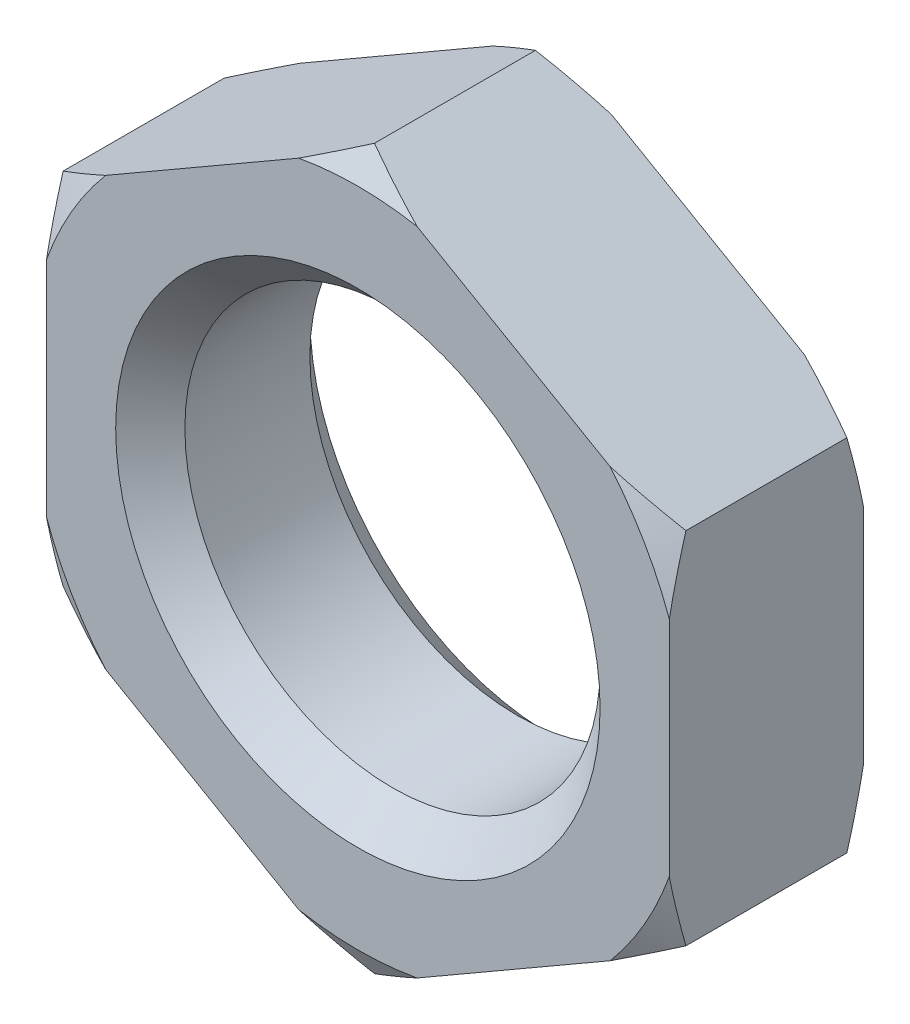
ISO-10303-21;
HEADER;
FILE_DESCRIPTION(('STEP AP214'),'2;1');
FILE_NAME('part.step','',(''),(''),'','','');
FILE_SCHEMA(('AUTOMOTIVE_DESIGN { 1 0 10303 214 1 1 1 1 }'));
ENDSEC;
DATA;
#1=APPLICATION_CONTEXT('core data for automotive mechanical design processes');
#2=APPLICATION_PROTOCOL_DEFINITION('international standard','automotive_design',2000,#1);
#3=PRODUCT_CONTEXT('',#1,'mechanical');
#4=PRODUCT('Part','Part','',(#3));
#5=PRODUCT_RELATED_PRODUCT_CATEGORY('part','',(#4));
#6=PRODUCT_DEFINITION_FORMATION('','',#4);
#7=PRODUCT_DEFINITION_CONTEXT('part definition',#1,'design');
#8=PRODUCT_DEFINITION('design','',#6,#7);
#9=PRODUCT_DEFINITION_SHAPE('','',#8);
#10=(LENGTH_UNIT() NAMED_UNIT(*) SI_UNIT(.MILLI.,.METRE.));
#11=(NAMED_UNIT(*) PLANE_ANGLE_UNIT() SI_UNIT($,.RADIAN.));
#12=(NAMED_UNIT(*) SI_UNIT($,.STERADIAN.) SOLID_ANGLE_UNIT());
#13=UNCERTAINTY_MEASURE_WITH_UNIT(LENGTH_MEASURE(1.E-05),#10,'distance_accuracy_value','');
#14=(GEOMETRIC_REPRESENTATION_CONTEXT(3) GLOBAL_UNCERTAINTY_ASSIGNED_CONTEXT((#13)) GLOBAL_UNIT_ASSIGNED_CONTEXT((#10,
#11,#12)) REPRESENTATION_CONTEXT('',''));
#15=CARTESIAN_POINT('',(0.,0.,0.));
#16=DIRECTION('',(0.,0.,1.));
#17=DIRECTION('',(1.,0.,0.));
#18=AXIS2_PLACEMENT_3D('',#15,#16,#17);
#19=CARTESIAN_POINT('',(0.,0.,-4.21));
#20=DIRECTION('',(0.,0.,1.));
#21=DIRECTION('',(1.,0.,0.));
#22=AXIS2_PLACEMENT_3D('',#19,#20,#21);
#23=PLANE('',#22);
#24=CARTESIAN_POINT('',(0.,0.,-4.21));
#25=DIRECTION('',(0.,0.,1.));
#26=DIRECTION('',(1.,0.,0.));
#27=AXIS2_PLACEMENT_3D('',#24,#25,#26);
#28=CIRCLE('',#27,10.5);
#29=CARTESIAN_POINT('',(10.5,0.,-4.21));
#30=VERTEX_POINT('',#29);
#31=EDGE_CURVE('E425',#30,#30,#28,.T.);
#32=ORIENTED_EDGE('',*,*,#31,.T.);
#33=EDGE_LOOP('',(#32));
#34=FACE_BOUND('',#33,.T.);
#35=DIRECTION('',(0.,1.,0.));
#36=VECTOR('',#35,1.);
#37=CARTESIAN_POINT('',(13.5,-7.79422863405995,-4.21));
#38=LINE('',#37,#36);
#39=CARTESIAN_POINT('',(13.5,-4.83128935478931,-4.21));
#40=VERTEX_POINT('',#39);
#41=CARTESIAN_POINT('',(13.5,4.83128935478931,-4.21));
#42=VERTEX_POINT('',#41);
#43=EDGE_CURVE('E361',#40,#42,#38,.T.);
#44=ORIENTED_EDGE('',*,*,#43,.F.);
#45=CARTESIAN_POINT('',(0.,0.,-4.21));
#46=DIRECTION('',(0.,0.,-1.));
#47=DIRECTION('',(-1.,0.,0.));
#48=AXIS2_PLACEMENT_3D('',#45,#46,#47);
#49=CIRCLE('',#48,14.3384572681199);
#50=CARTESIAN_POINT('',(10.9340193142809,-9.27569827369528,-4.21));
#51=VERTEX_POINT('',#50);
#52=EDGE_CURVE('E349',#40,#51,#49,.T.);
#53=ORIENTED_EDGE('',*,*,#52,.T.);
#54=DIRECTION('',(0.866025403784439,0.5,0.));
#55=VECTOR('',#54,1.);
#56=CARTESIAN_POINT('',(0.,-15.5884572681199,-4.21));
#57=LINE('',#56,#55);
#58=CARTESIAN_POINT('',(2.56598068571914,-14.1069876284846,-4.21));
#59=VERTEX_POINT('',#58);
#60=EDGE_CURVE('E372',#59,#51,#57,.T.);
#61=ORIENTED_EDGE('',*,*,#60,.F.);
#62=CARTESIAN_POINT('',(-2.56598068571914,-14.1069876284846,-4.21));
#63=VERTEX_POINT('',#62);
#64=EDGE_CURVE('E343',#59,#63,#49,.T.);
#65=ORIENTED_EDGE('',*,*,#64,.T.);
#66=DIRECTION('',(0.866025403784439,-0.5,0.));
#67=VECTOR('',#66,1.);
#68=CARTESIAN_POINT('',(-13.5,-7.79422863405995,-4.21));
#69=LINE('',#68,#67);
#70=CARTESIAN_POINT('',(-10.9340193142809,-9.27569827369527,-4.21));
#71=VERTEX_POINT('',#70);
#72=EDGE_CURVE('E379',#71,#63,#69,.T.);
#73=ORIENTED_EDGE('',*,*,#72,.F.);
#74=CARTESIAN_POINT('',(-13.5,-4.83128935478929,-4.21));
#75=VERTEX_POINT('',#74);
#76=EDGE_CURVE('E336',#71,#75,#49,.T.);
#77=ORIENTED_EDGE('',*,*,#76,.T.);
#78=DIRECTION('',(0.,-1.,0.));
#79=VECTOR('',#78,1.);
#80=CARTESIAN_POINT('',(-13.5,7.79422863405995,-4.21));
#81=LINE('',#80,#79);
#82=CARTESIAN_POINT('',(-13.5,4.83128935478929,-4.21));
#83=VERTEX_POINT('',#82);
#84=EDGE_CURVE('E476',#83,#75,#81,.T.);
#85=ORIENTED_EDGE('',*,*,#84,.F.);
#86=CARTESIAN_POINT('',(-10.9340193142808,9.27569827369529,-4.21));
#87=VERTEX_POINT('',#86);
#88=EDGE_CURVE('E63',#83,#87,#49,.T.);
#89=ORIENTED_EDGE('',*,*,#88,.T.);
#90=DIRECTION('',(-0.866025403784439,-0.5,0.));
#91=VECTOR('',#90,1.);
#92=CARTESIAN_POINT('',(0.,15.5884572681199,-4.21));
#93=LINE('',#92,#91);
#94=CARTESIAN_POINT('',(-2.56598068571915,14.1069876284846,-4.21));
#95=VERTEX_POINT('',#94);
#96=EDGE_CURVE('E181',#95,#87,#93,.T.);
#97=ORIENTED_EDGE('',*,*,#96,.F.);
#98=CARTESIAN_POINT('',(2.56598068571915,14.1069876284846,-4.21));
#99=VERTEX_POINT('',#98);
#100=EDGE_CURVE('E55',#95,#99,#49,.T.);
#101=ORIENTED_EDGE('',*,*,#100,.T.);
#102=DIRECTION('',(-0.866025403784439,0.5,0.));
#103=VECTOR('',#102,1.);
#104=CARTESIAN_POINT('',(13.5,7.79422863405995,-4.21));
#105=LINE('',#104,#103);
#106=CARTESIAN_POINT('',(10.9340193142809,9.27569827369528,-4.21));
#107=VERTEX_POINT('',#106);
#108=EDGE_CURVE('E362',#107,#99,#105,.T.);
#109=ORIENTED_EDGE('',*,*,#108,.F.);
#110=EDGE_CURVE('E340',#107,#42,#49,.T.);
#111=ORIENTED_EDGE('',*,*,#110,.T.);
#112=EDGE_LOOP('',(#44,#53,#61,#65,#73,#77,#85,#89,#97,#101,#109,#111));
#113=FACE_BOUND('',#112,.T.);
#114=ADVANCED_FACE('F39',(#34,#113),#23,.F.);
#115=CARTESIAN_POINT('',(0.,0.,4.21));
#116=DIRECTION('',(0.,0.,1.));
#117=DIRECTION('',(1.,0.,0.));
#118=AXIS2_PLACEMENT_3D('',#115,#116,#117);
#119=PLANE('',#118);
#120=CARTESIAN_POINT('',(0.,0.,4.21));
#121=DIRECTION('',(0.,0.,1.));
#122=DIRECTION('',(1.,0.,0.));
#123=AXIS2_PLACEMENT_3D('',#120,#121,#122);
#124=CIRCLE('',#123,10.5);
#125=CARTESIAN_POINT('',(10.5,0.,4.21));
#126=VERTEX_POINT('',#125);
#127=EDGE_CURVE('E11',#126,#126,#124,.F.);
#128=ORIENTED_EDGE('',*,*,#127,.T.);
#129=EDGE_LOOP('',(#128));
#130=FACE_BOUND('',#129,.T.);
#131=CARTESIAN_POINT('',(0.,0.,4.21));
#132=DIRECTION('',(0.,0.,-1.));
#133=DIRECTION('',(-1.,0.,0.));
#134=AXIS2_PLACEMENT_3D('',#131,#132,#133);
#135=CIRCLE('',#134,14.3384572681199);
#136=CARTESIAN_POINT('',(13.5,-4.83128935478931,4.21));
#137=VERTEX_POINT('',#136);
#138=CARTESIAN_POINT('',(10.9340193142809,-9.27569827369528,4.21));
#139=VERTEX_POINT('',#138);
#140=EDGE_CURVE('E312',#137,#139,#135,.T.);
#141=ORIENTED_EDGE('',*,*,#140,.F.);
#142=DIRECTION('',(0.,1.,0.));
#143=VECTOR('',#142,1.);
#144=CARTESIAN_POINT('',(13.5,-7.79422863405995,4.21));
#145=LINE('',#144,#143);
#146=CARTESIAN_POINT('',(13.5,4.83128935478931,4.21));
#147=VERTEX_POINT('',#146);
#148=EDGE_CURVE('E387',#137,#147,#145,.T.);
#149=ORIENTED_EDGE('',*,*,#148,.T.);
#150=CARTESIAN_POINT('',(10.9340193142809,9.27569827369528,4.21));
#151=VERTEX_POINT('',#150);
#152=EDGE_CURVE('E305',#151,#147,#135,.T.);
#153=ORIENTED_EDGE('',*,*,#152,.F.);
#154=DIRECTION('',(-0.866025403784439,0.5,0.));
#155=VECTOR('',#154,1.);
#156=CARTESIAN_POINT('',(13.5,7.79422863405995,4.21));
#157=LINE('',#156,#155);
#158=CARTESIAN_POINT('',(2.56598068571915,14.1069876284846,4.21));
#159=VERTEX_POINT('',#158);
#160=EDGE_CURVE('E371',#151,#159,#157,.T.);
#161=ORIENTED_EDGE('',*,*,#160,.T.);
#162=CARTESIAN_POINT('',(-2.56598068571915,14.1069876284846,4.21));
#163=VERTEX_POINT('',#162);
#164=EDGE_CURVE('E296',#163,#159,#135,.T.);
#165=ORIENTED_EDGE('',*,*,#164,.F.);
#166=DIRECTION('',(-0.866025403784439,-0.5,0.));
#167=VECTOR('',#166,1.);
#168=CARTESIAN_POINT('',(0.,15.5884572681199,4.21));
#169=LINE('',#168,#167);
#170=CARTESIAN_POINT('',(-10.9340193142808,9.27569827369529,4.21));
#171=VERTEX_POINT('',#170);
#172=EDGE_CURVE('E377',#163,#171,#169,.T.);
#173=ORIENTED_EDGE('',*,*,#172,.T.);
#174=CARTESIAN_POINT('',(-13.5,4.83128935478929,4.21));
#175=VERTEX_POINT('',#174);
#176=EDGE_CURVE('E294',#175,#171,#135,.T.);
#177=ORIENTED_EDGE('',*,*,#176,.F.);
#178=DIRECTION('',(0.,-1.,0.));
#179=VECTOR('',#178,1.);
#180=CARTESIAN_POINT('',(-13.5,7.79422863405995,4.21));
#181=LINE('',#180,#179);
#182=CARTESIAN_POINT('',(-13.5,-4.83128935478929,4.21));
#183=VERTEX_POINT('',#182);
#184=EDGE_CURVE('E663',#175,#183,#181,.T.);
#185=ORIENTED_EDGE('',*,*,#184,.T.);
#186=CARTESIAN_POINT('',(-10.9340193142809,-9.27569827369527,4.21));
#187=VERTEX_POINT('',#186);
#188=EDGE_CURVE('E297',#187,#183,#135,.T.);
#189=ORIENTED_EDGE('',*,*,#188,.F.);
#190=DIRECTION('',(0.866025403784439,-0.5,0.));
#191=VECTOR('',#190,1.);
#192=CARTESIAN_POINT('',(-13.5,-7.79422863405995,4.21));
#193=LINE('',#192,#191);
#194=CARTESIAN_POINT('',(-2.56598068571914,-14.1069876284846,4.21));
#195=VERTEX_POINT('',#194);
#196=EDGE_CURVE('E468',#187,#195,#193,.T.);
#197=ORIENTED_EDGE('',*,*,#196,.T.);
#198=CARTESIAN_POINT('',(2.56598068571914,-14.1069876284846,4.21));
#199=VERTEX_POINT('',#198);
#200=EDGE_CURVE('E306',#199,#195,#135,.T.);
#201=ORIENTED_EDGE('',*,*,#200,.F.);
#202=DIRECTION('',(0.866025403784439,0.5,0.));
#203=VECTOR('',#202,1.);
#204=CARTESIAN_POINT('',(0.,-15.5884572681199,4.21));
#205=LINE('',#204,#203);
#206=EDGE_CURVE('E464',#199,#139,#205,.T.);
#207=ORIENTED_EDGE('',*,*,#206,.T.);
#208=EDGE_LOOP('',(#141,#149,#153,#161,#165,#173,#177,#185,#189,#197,#201,#207));
#209=FACE_BOUND('',#208,.T.);
#210=ADVANCED_FACE('F416',(#130,#209),#119,.T.);
#211=CARTESIAN_POINT('',(13.5,7.79422863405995,4.21));
#212=DIRECTION('',(-0.5,-0.866025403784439,0.));
#213=DIRECTION('',(0.866025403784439,-0.5,0.));
#214=AXIS2_PLACEMENT_3D('',#211,#212,#213);
#215=PLANE('',#214);
#216=DIRECTION('',(0.,0.,-1.));
#217=VECTOR('',#216,1.);
#218=CARTESIAN_POINT('',(13.5,7.79422863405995,4.21));
#219=LINE('',#218,#217);
#220=CARTESIAN_POINT('',(13.5,7.79422863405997,3.48831216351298));
#221=VERTEX_POINT('',#220);
#222=CARTESIAN_POINT('',(13.5,7.79422863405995,-3.48831216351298));
#223=VERTEX_POINT('',#222);
#224=EDGE_CURVE('E383',#221,#223,#219,.T.);
#225=ORIENTED_EDGE('',*,*,#224,.T.);
#226=CARTESIAN_POINT('',(22.8632924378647,2.38832922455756,0.783641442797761));
#227=CARTESIAN_POINT('',(22.4391976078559,2.6331804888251,0.554852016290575));
#228=CARTESIAN_POINT('',(22.0140869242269,2.8786182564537,0.328534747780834));
#229=CARTESIAN_POINT('',(21.1614054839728,3.3709141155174,-0.117994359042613));
#230=CARTESIAN_POINT('',(20.7338344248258,3.61777238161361,-0.33820542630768));
#231=CARTESIAN_POINT('',(19.874530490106,4.11389173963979,-0.771999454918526));
#232=CARTESIAN_POINT('',(19.4427886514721,4.36315800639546,-0.98555881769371));
#233=CARTESIAN_POINT('',(18.5760675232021,4.86355968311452,-1.40371105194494));
#234=CARTESIAN_POINT('',(18.1410883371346,5.11469503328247,-1.60830420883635));
#235=CARTESIAN_POINT('',(17.2563017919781,5.6255267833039,-2.01160763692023));
#236=CARTESIAN_POINT('',(16.8063980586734,5.88527882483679,-2.21003731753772));
#237=CARTESIAN_POINT('',(15.9020497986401,6.4074045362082,-2.59273738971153));
#238=CARTESIAN_POINT('',(15.4476050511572,6.66977833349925,-2.77700708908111));
#239=CARTESIAN_POINT('',(14.5340709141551,7.19720751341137,-3.12787383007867));
#240=CARTESIAN_POINT('',(14.0749864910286,7.46226002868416,-3.29448794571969));
#241=CARTESIAN_POINT('',(13.1514277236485,7.99547693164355,-3.60619230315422));
#242=CARTESIAN_POINT('',(12.6869540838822,8.26364091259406,-3.75128532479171));
#243=CARTESIAN_POINT('',(11.5760116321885,8.90504383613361,-4.06509620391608));
#244=CARTESIAN_POINT('',(10.9269534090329,9.27977777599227,-4.22209482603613));
#245=CARTESIAN_POINT('',(9.9467414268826,9.84570342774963,-4.41067136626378));
#246=CARTESIAN_POINT('',(9.61891590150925,10.0349735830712,-4.46570846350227));
#247=CARTESIAN_POINT('',(8.96143126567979,10.4145725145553,-4.55876620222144));
#248=CARTESIAN_POINT('',(8.63177217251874,10.6049012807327,-4.59678700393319));
#249=CARTESIAN_POINT('',(7.97508323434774,10.9840408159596,-4.6543797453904));
#250=CARTESIAN_POINT('',(7.64806718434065,11.1728436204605,-4.67416034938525));
#251=CARTESIAN_POINT('',(6.99358765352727,11.5507075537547,-4.69543741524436));
#252=CARTESIAN_POINT('',(6.66612417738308,11.7397686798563,-4.69693406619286));
#253=CARTESIAN_POINT('',(6.01152258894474,12.1177030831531,-4.68159543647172));
#254=CARTESIAN_POINT('',(5.68438447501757,12.3065763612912,-4.66476024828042));
#255=CARTESIAN_POINT('',(5.03112750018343,12.6837344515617,-4.61326720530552));
#256=CARTESIAN_POINT('',(4.70500880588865,12.8720191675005,-4.57860657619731));
#257=CARTESIAN_POINT('',(3.93422960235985,13.3170287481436,-4.47649903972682));
#258=CARTESIAN_POINT('',(3.49029697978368,13.5733333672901,-4.40166959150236));
#259=CARTESIAN_POINT('',(2.60668932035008,14.0834844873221,-4.22388121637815));
#260=CARTESIAN_POINT('',(2.16701491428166,14.3373306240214,-4.12091818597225));
#261=CARTESIAN_POINT('',(1.29197412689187,14.8425356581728,-3.89075009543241));
#262=CARTESIAN_POINT('',(0.856613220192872,15.0938913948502,-3.76351756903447));
#263=CARTESIAN_POINT('',(-0.00921792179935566,15.5937792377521,-3.48881826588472));
#264=CARTESIAN_POINT('',(-0.439688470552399,15.8423115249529,-3.34135279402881));
#265=CARTESIAN_POINT('',(-1.30112575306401,16.339662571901,-3.02783694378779));
#266=CARTESIAN_POINT('',(-1.73203743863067,16.5884495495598,-2.86158629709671));
#267=CARTESIAN_POINT('',(-2.5892960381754,17.0833880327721,-2.51515223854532));
#268=CARTESIAN_POINT('',(-3.0156457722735,17.3295411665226,-2.33497807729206));
#269=CARTESIAN_POINT('',(-3.86443604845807,17.8195904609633,-1.96317934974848));
#270=CARTESIAN_POINT('',(-4.28687761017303,18.0634872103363,-1.77155787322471));
#271=CARTESIAN_POINT('',(-5.12849948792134,18.5493978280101,-1.37883852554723));
#272=CARTESIAN_POINT('',(-5.54767936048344,18.7914114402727,-1.17773939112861));
#273=CARTESIAN_POINT('',(-6.25245227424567,19.1983122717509,-0.831867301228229));
#274=CARTESIAN_POINT('',(-6.53880770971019,19.3636396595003,-0.689156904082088));
#275=CARTESIAN_POINT('',(-7.11027597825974,19.6935770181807,-0.400485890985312));
#276=CARTESIAN_POINT('',(-7.3953888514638,19.8581870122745,-0.254525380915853));
#277=CARTESIAN_POINT('',(-7.96152559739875,20.1850462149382,0.0387259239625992));
#278=CARTESIAN_POINT('',(-8.24256107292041,20.3473021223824,0.18598689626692));
#279=CARTESIAN_POINT('',(-8.80364395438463,20.6712434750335,0.483013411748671));
#280=CARTESIAN_POINT('',(-9.0836913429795,20.8329289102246,0.632778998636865));
#281=CARTESIAN_POINT('',(-9.36329243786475,20.9943566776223,0.783641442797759));
#282=B_SPLINE_CURVE_WITH_KNOTS('',3,(#226,#227,#228,#229,#230,#231,#232,#233,#234,#235,#236,
#237,#238,#239,#240,#241,#242,#243,#244,#245,#246,#247,#248,#249,#250,#251,#252,#253,#254,#255,
#256,#257,#258,#259,#260,#261,#262,#263,#264,#265,#266,#267,#268,#269,#270,#271,#272,#273,#274,
#275,#276,#277,#278,#279,#280,#281),.UNSPECIFIED.,.F.,.F.,(4,2,2,2,2,2,2,2,2,2,2,2,2,2,2,2,2,2,
2,2,2,2,2,2,2,2,2,4),(0.,1.6215532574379,3.24331034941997,4.87028402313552,6.49720586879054,
8.16536850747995,9.83361263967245,11.500228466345,13.166628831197,15.4613373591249,
16.6085813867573,17.7558146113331,18.889754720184,20.0236831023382,21.1576057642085,
22.2917049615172,23.8448910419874,25.3983037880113,26.9534851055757,28.5085661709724,
30.0821517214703,31.6547006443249,33.2268270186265,34.799163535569,35.8795583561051,
36.9599180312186,38.0289924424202,39.0980855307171),.UNSPECIFIED.);
#283=EDGE_CURVE('E316',#223,#107,#282,.T.);
#284=ORIENTED_EDGE('',*,*,#283,.T.);
#285=ORIENTED_EDGE('',*,*,#108,.T.);
#286=CARTESIAN_POINT('',(0.,15.5884572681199,-3.48831216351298));
#287=VERTEX_POINT('',#286);
#288=EDGE_CURVE('E307',#99,#287,#282,.T.);
#289=ORIENTED_EDGE('',*,*,#288,.T.);
#290=DIRECTION('',(0.,0.,-1.));
#291=VECTOR('',#290,1.);
#292=CARTESIAN_POINT('',(0.,15.5884572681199,4.21));
#293=LINE('',#292,#291);
#294=CARTESIAN_POINT('',(0.,15.5884572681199,3.48831216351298));
#295=VERTEX_POINT('',#294);
#296=EDGE_CURVE('E190',#295,#287,#293,.T.);
#297=ORIENTED_EDGE('',*,*,#296,.F.);
#298=CARTESIAN_POINT('',(-9.36329243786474,20.9943566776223,-0.783641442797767));
#299=CARTESIAN_POINT('',(-8.93919760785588,20.7495054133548,-0.554852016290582));
#300=CARTESIAN_POINT('',(-8.51408692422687,20.5040676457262,-0.32853474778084));
#301=CARTESIAN_POINT('',(-7.66140548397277,20.0117717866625,0.117994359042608));
#302=CARTESIAN_POINT('',(-7.23383442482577,19.7649135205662,0.338205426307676));
#303=CARTESIAN_POINT('',(-6.37453049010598,19.2687941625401,0.771999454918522));
#304=CARTESIAN_POINT('',(-5.94278865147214,19.0195278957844,0.985558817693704));
#305=CARTESIAN_POINT('',(-5.07606752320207,18.5191262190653,1.40371105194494));
#306=CARTESIAN_POINT('',(-4.64108833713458,18.2679908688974,1.60830420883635));
#307=CARTESIAN_POINT('',(-3.75630179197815,17.757159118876,2.01160763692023));
#308=CARTESIAN_POINT('',(-3.30639805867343,17.4974070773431,2.21003731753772));
#309=CARTESIAN_POINT('',(-2.4020497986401,16.9752813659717,2.59273738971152));
#310=CARTESIAN_POINT('',(-1.94760505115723,16.7129075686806,2.7770070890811));
#311=CARTESIAN_POINT('',(-1.03407091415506,16.1854783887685,3.12787383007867));
#312=CARTESIAN_POINT('',(-0.574986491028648,15.9204258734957,3.29448794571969));
#313=CARTESIAN_POINT('',(0.348572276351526,15.3872089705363,3.60619230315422));
#314=CARTESIAN_POINT('',(0.813045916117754,15.1190449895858,3.75128532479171));
#315=CARTESIAN_POINT('',(1.92398836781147,14.4776420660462,4.06509620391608));
#316=CARTESIAN_POINT('',(2.57304659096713,14.1029081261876,4.22209482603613));
#317=CARTESIAN_POINT('',(3.5532585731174,13.5369824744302,4.41067136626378));
#318=CARTESIAN_POINT('',(3.88108409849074,13.3477123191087,4.46570846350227));
#319=CARTESIAN_POINT('',(4.53856873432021,12.9681133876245,4.55876620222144));
#320=CARTESIAN_POINT('',(4.86822782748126,12.7777846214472,4.59678700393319));
#321=CARTESIAN_POINT('',(5.52491676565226,12.3986450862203,4.6543797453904));
#322=CARTESIAN_POINT('',(5.85193281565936,12.2098422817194,4.67416034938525));
#323=CARTESIAN_POINT('',(6.50641234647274,11.8319783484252,4.69543741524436));
#324=CARTESIAN_POINT('',(6.83387582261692,11.6429172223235,4.69693406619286));
#325=CARTESIAN_POINT('',(7.48847741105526,11.2649828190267,4.68159543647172));
#326=CARTESIAN_POINT('',(7.81561552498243,11.0761095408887,4.66476024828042));
#327=CARTESIAN_POINT('',(8.46887249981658,10.6989514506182,4.61326720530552));
#328=CARTESIAN_POINT('',(8.79499119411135,10.5106667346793,4.57860657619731));
#329=CARTESIAN_POINT('',(9.56577039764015,10.0656571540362,4.47649903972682));
#330=CARTESIAN_POINT('',(10.0097030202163,9.8093525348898,4.40166959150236));
#331=CARTESIAN_POINT('',(10.8933106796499,9.29920141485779,4.22388121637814));
#332=CARTESIAN_POINT('',(11.3329850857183,9.0453552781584,4.12091818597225));
#333=CARTESIAN_POINT('',(12.2080258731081,8.540150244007,3.89075009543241));
#334=CARTESIAN_POINT('',(12.6433867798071,8.28879450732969,3.76351756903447));
#335=CARTESIAN_POINT('',(13.5092179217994,7.78890666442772,3.48881826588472));
#336=CARTESIAN_POINT('',(13.9396884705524,7.54037437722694,3.3413527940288));
#337=CARTESIAN_POINT('',(14.801125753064,7.04302333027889,3.02783694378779));
#338=CARTESIAN_POINT('',(15.2320374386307,6.79423635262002,2.86158629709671));
#339=CARTESIAN_POINT('',(16.0892960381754,6.29929786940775,2.51515223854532));
#340=CARTESIAN_POINT('',(16.5156457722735,6.05314473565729,2.33497807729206));
#341=CARTESIAN_POINT('',(17.3644360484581,5.56309544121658,1.96317934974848));
#342=CARTESIAN_POINT('',(17.786877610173,5.31919869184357,1.77155787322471));
#343=CARTESIAN_POINT('',(18.6284994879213,4.8332880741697,1.37883852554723));
#344=CARTESIAN_POINT('',(19.0476793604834,4.5912744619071,1.17773939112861));
#345=CARTESIAN_POINT('',(19.7524522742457,4.18437363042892,0.831867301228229));
#346=CARTESIAN_POINT('',(20.0388077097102,4.01904624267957,0.689156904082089));
#347=CARTESIAN_POINT('',(20.6102759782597,3.68910888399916,0.400485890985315));
#348=CARTESIAN_POINT('',(20.8953888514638,3.52449888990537,0.254525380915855));
#349=CARTESIAN_POINT('',(21.4615255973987,3.19763968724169,-0.0387259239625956));
#350=CARTESIAN_POINT('',(21.7425610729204,3.03538377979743,-0.185986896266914));
#351=CARTESIAN_POINT('',(22.3036439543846,2.71144242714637,-0.483013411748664));
#352=CARTESIAN_POINT('',(22.5836913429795,2.54975699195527,-0.632778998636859));
#353=CARTESIAN_POINT('',(22.8632924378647,2.38832922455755,-0.783641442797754));
#354=B_SPLINE_CURVE_WITH_KNOTS('',3,(#298,#299,#300,#301,#302,#303,#304,#305,#306,#307,#308,
#309,#310,#311,#312,#313,#314,#315,#316,#317,#318,#319,#320,#321,#322,#323,#324,#325,#326,#327,
#328,#329,#330,#331,#332,#333,#334,#335,#336,#337,#338,#339,#340,#341,#342,#343,#344,#345,#346,
#347,#348,#349,#350,#351,#352,#353),.UNSPECIFIED.,.F.,.F.,(4,2,2,2,2,2,2,2,2,2,2,2,2,2,2,2,2,2,
2,2,2,2,2,2,2,2,2,4),(0.,1.6215532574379,3.24331034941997,4.87028402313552,6.49720586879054,
8.16536850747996,9.83361263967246,11.500228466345,13.166628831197,15.4613373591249,
16.6085813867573,17.7558146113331,18.889754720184,20.0236831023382,21.1576057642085,
22.2917049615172,23.8448910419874,25.3983037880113,26.9534851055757,28.5085661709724,
30.0821517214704,31.6547006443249,33.2268270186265,34.799163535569,35.8795583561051,
36.9599180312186,38.0289924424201,39.098085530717),.UNSPECIFIED.);
#355=EDGE_CURVE('E474',#295,#159,#354,.T.);
#356=ORIENTED_EDGE('',*,*,#355,.T.);
#357=ORIENTED_EDGE('',*,*,#160,.F.);
#358=EDGE_CURVE('E247',#151,#221,#354,.T.);
#359=ORIENTED_EDGE('',*,*,#358,.T.);
#360=EDGE_LOOP('',(#225,#284,#285,#289,#297,#356,#357,#359));
#361=FACE_BOUND('',#360,.T.);
#362=ADVANCED_FACE('F421',(#361),#215,.F.);
#363=CARTESIAN_POINT('',(0.,15.5884572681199,4.21));
#364=DIRECTION('',(0.5,-0.866025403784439,0.));
#365=DIRECTION('',(0.866025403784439,0.5,0.));
#366=AXIS2_PLACEMENT_3D('',#363,#364,#365);
#367=PLANE('',#366);
#368=ORIENTED_EDGE('',*,*,#296,.T.);
#369=CARTESIAN_POINT('',(9.36329243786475,20.9943566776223,0.783641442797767));
#370=CARTESIAN_POINT('',(8.93919760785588,20.7495054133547,0.554852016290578));
#371=CARTESIAN_POINT('',(8.51408692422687,20.5040676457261,0.328534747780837));
#372=CARTESIAN_POINT('',(7.66140548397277,20.0117717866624,-0.11799435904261));
#373=CARTESIAN_POINT('',(7.23383442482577,19.7649135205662,-0.338205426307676));
#374=CARTESIAN_POINT('',(6.37453049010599,19.2687941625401,-0.771999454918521));
#375=CARTESIAN_POINT('',(5.94278865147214,19.0195278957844,-0.985558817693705));
#376=CARTESIAN_POINT('',(5.07606752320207,18.5191262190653,-1.40371105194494));
#377=CARTESIAN_POINT('',(4.64108833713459,18.2679908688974,-1.60830420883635));
#378=CARTESIAN_POINT('',(3.75630179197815,17.757159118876,-2.01160763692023));
#379=CARTESIAN_POINT('',(3.30639805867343,17.4974070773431,-2.21003731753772));
#380=CARTESIAN_POINT('',(2.40204979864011,16.9752813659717,-2.59273738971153));
#381=CARTESIAN_POINT('',(1.94760505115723,16.7129075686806,-2.7770070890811));
#382=CARTESIAN_POINT('',(1.03407091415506,16.1854783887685,-3.12787383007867));
#383=CARTESIAN_POINT('',(0.574986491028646,15.9204258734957,-3.29448794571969));
#384=CARTESIAN_POINT('',(-0.348572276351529,15.3872089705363,-3.60619230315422));
#385=CARTESIAN_POINT('',(-0.813045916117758,15.1190449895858,-3.75128532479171));
#386=CARTESIAN_POINT('',(-1.92398836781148,14.4776420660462,-4.06509620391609));
#387=CARTESIAN_POINT('',(-2.57304659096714,14.1029081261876,-4.22209482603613));
#388=CARTESIAN_POINT('',(-3.55325857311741,13.5369824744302,-4.41067136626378));
#389=CARTESIAN_POINT('',(-3.88108409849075,13.3477123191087,-4.46570846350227));
#390=CARTESIAN_POINT('',(-4.53856873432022,12.9681133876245,-4.55876620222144));
#391=CARTESIAN_POINT('',(-4.86822782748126,12.7777846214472,-4.59678700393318));
#392=CARTESIAN_POINT('',(-5.52491676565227,12.3986450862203,-4.65437974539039));
#393=CARTESIAN_POINT('',(-5.85193281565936,12.2098422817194,-4.67416034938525));
#394=CARTESIAN_POINT('',(-6.50641234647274,11.8319783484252,-4.69543741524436));
#395=CARTESIAN_POINT('',(-6.83387582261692,11.6429172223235,-4.69693406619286));
#396=CARTESIAN_POINT('',(-7.48847741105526,11.2649828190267,-4.68159543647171));
#397=CARTESIAN_POINT('',(-7.81561552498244,11.0761095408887,-4.66476024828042));
#398=CARTESIAN_POINT('',(-8.46887249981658,10.6989514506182,-4.61326720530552));
#399=CARTESIAN_POINT('',(-8.79499119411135,10.5106667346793,-4.5786065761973));
#400=CARTESIAN_POINT('',(-9.56577039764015,10.0656571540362,-4.47649903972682));
#401=CARTESIAN_POINT('',(-10.0097030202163,9.8093525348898,-4.40166959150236));
#402=CARTESIAN_POINT('',(-10.8933106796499,9.29920141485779,-4.22388121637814));
#403=CARTESIAN_POINT('',(-11.3329850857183,9.0453552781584,-4.12091818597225));
#404=CARTESIAN_POINT('',(-12.2080258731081,8.540150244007,-3.89075009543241));
#405=CARTESIAN_POINT('',(-12.6433867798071,8.2887945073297,-3.76351756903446));
#406=CARTESIAN_POINT('',(-13.5092179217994,7.78890666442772,-3.48881826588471));
#407=CARTESIAN_POINT('',(-13.9396884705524,7.54037437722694,-3.3413527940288));
#408=CARTESIAN_POINT('',(-14.801125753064,7.04302333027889,-3.02783694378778));
#409=CARTESIAN_POINT('',(-15.2320374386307,6.79423635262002,-2.8615862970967));
#410=CARTESIAN_POINT('',(-16.0892960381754,6.29929786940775,-2.51515223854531));
#411=CARTESIAN_POINT('',(-16.5156457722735,6.05314473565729,-2.33497807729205));
#412=CARTESIAN_POINT('',(-17.3644360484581,5.56309544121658,-1.96317934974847));
#413=CARTESIAN_POINT('',(-17.7868776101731,5.31919869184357,-1.7715578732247));
#414=CARTESIAN_POINT('',(-18.6284994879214,4.8332880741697,-1.37883852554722));
#415=CARTESIAN_POINT('',(-19.0476793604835,4.5912744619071,-1.1777393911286));
#416=CARTESIAN_POINT('',(-19.7524522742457,4.18437363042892,-0.831867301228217));
#417=CARTESIAN_POINT('',(-20.0388077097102,4.01904624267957,-0.689156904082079));
#418=CARTESIAN_POINT('',(-20.6102759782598,3.68910888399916,-0.400485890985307));
#419=CARTESIAN_POINT('',(-20.8953888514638,3.52449888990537,-0.254525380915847));
#420=CARTESIAN_POINT('',(-21.4615255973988,3.19763968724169,0.0387259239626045));
#421=CARTESIAN_POINT('',(-21.7425610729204,3.03538377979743,0.185986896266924));
#422=CARTESIAN_POINT('',(-22.3036439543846,2.71144242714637,0.483013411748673));
#423=CARTESIAN_POINT('',(-22.5836913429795,2.54975699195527,0.632778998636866));
#424=CARTESIAN_POINT('',(-22.8632924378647,2.38832922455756,0.783641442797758));
#425=B_SPLINE_CURVE_WITH_KNOTS('',3,(#369,#370,#371,#372,#373,#374,#375,#376,#377,#378,#379,
#380,#381,#382,#383,#384,#385,#386,#387,#388,#389,#390,#391,#392,#393,#394,#395,#396,#397,#398,
#399,#400,#401,#402,#403,#404,#405,#406,#407,#408,#409,#410,#411,#412,#413,#414,#415,#416,#417,
#418,#419,#420,#421,#422,#423,#424),.UNSPECIFIED.,.F.,.F.,(4,2,2,2,2,2,2,2,2,2,2,2,2,2,2,2,2,2,
2,2,2,2,2,2,2,2,2,4),(0.,1.6215532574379,3.24331034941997,4.87028402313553,6.49720586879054,
8.16536850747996,9.83361263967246,11.500228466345,13.166628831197,15.4613373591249,
16.6085813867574,17.7558146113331,18.889754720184,20.0236831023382,21.1576057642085,
22.2917049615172,23.8448910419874,25.3983037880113,26.9534851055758,28.5085661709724,
30.0821517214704,31.6547006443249,33.2268270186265,34.7991635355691,35.8795583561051,
36.9599180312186,38.0289924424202,39.098085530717),.UNSPECIFIED.);
#426=EDGE_CURVE('E183',#287,#95,#425,.T.);
#427=ORIENTED_EDGE('',*,*,#426,.T.);
#428=ORIENTED_EDGE('',*,*,#96,.T.);
#429=CARTESIAN_POINT('',(-13.5,7.79422863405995,-3.48831216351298));
#430=VERTEX_POINT('',#429);
#431=EDGE_CURVE('E165',#87,#430,#425,.T.);
#432=ORIENTED_EDGE('',*,*,#431,.T.);
#433=DIRECTION('',(0.,0.,-1.));
#434=VECTOR('',#433,1.);
#435=CARTESIAN_POINT('',(-13.5,7.79422863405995,4.21));
#436=LINE('',#435,#434);
#437=CARTESIAN_POINT('',(-13.5,7.79422863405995,3.48831216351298));
#438=VERTEX_POINT('',#437);
#439=EDGE_CURVE('E179',#438,#430,#436,.T.);
#440=ORIENTED_EDGE('',*,*,#439,.F.);
#441=CARTESIAN_POINT('',(-22.8632924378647,2.38832922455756,-0.783641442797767));
#442=CARTESIAN_POINT('',(-22.4391976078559,2.63318048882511,-0.554852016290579));
#443=CARTESIAN_POINT('',(-22.0140869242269,2.8786182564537,-0.328534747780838));
#444=CARTESIAN_POINT('',(-21.1614054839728,3.37091411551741,0.11799435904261));
#445=CARTESIAN_POINT('',(-20.7338344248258,3.61777238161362,0.338205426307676));
#446=CARTESIAN_POINT('',(-19.874530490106,4.11389173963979,0.771999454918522));
#447=CARTESIAN_POINT('',(-19.4427886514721,4.36315800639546,0.985558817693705));
#448=CARTESIAN_POINT('',(-18.5760675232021,4.86355968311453,1.40371105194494));
#449=CARTESIAN_POINT('',(-18.1410883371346,5.11469503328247,1.60830420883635));
#450=CARTESIAN_POINT('',(-17.2563017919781,5.6255267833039,2.01160763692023));
#451=CARTESIAN_POINT('',(-16.8063980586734,5.8852788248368,2.21003731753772));
#452=CARTESIAN_POINT('',(-15.9020497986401,6.40740453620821,2.59273738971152));
#453=CARTESIAN_POINT('',(-15.4476050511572,6.66977833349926,2.7770070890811));
#454=CARTESIAN_POINT('',(-14.5340709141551,7.19720751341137,3.12787383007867));
#455=CARTESIAN_POINT('',(-14.0749864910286,7.46226002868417,3.29448794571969));
#456=CARTESIAN_POINT('',(-13.1514277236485,7.99547693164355,3.60619230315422));
#457=CARTESIAN_POINT('',(-12.6869540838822,8.26364091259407,3.75128532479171));
#458=CARTESIAN_POINT('',(-11.5760116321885,8.90504383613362,4.06509620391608));
#459=CARTESIAN_POINT('',(-10.9269534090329,9.27977777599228,4.22209482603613));
#460=CARTESIAN_POINT('',(-9.9467414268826,9.84570342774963,4.41067136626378));
#461=CARTESIAN_POINT('',(-9.61891590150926,10.0349735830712,4.46570846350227));
#462=CARTESIAN_POINT('',(-8.96143126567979,10.4145725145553,4.55876620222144));
#463=CARTESIAN_POINT('',(-8.63177217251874,10.6049012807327,4.59678700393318));
#464=CARTESIAN_POINT('',(-7.97508323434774,10.9840408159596,4.65437974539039));
#465=CARTESIAN_POINT('',(-7.64806718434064,11.1728436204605,4.67416034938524));
#466=CARTESIAN_POINT('',(-6.99358765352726,11.5507075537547,4.69543741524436));
#467=CARTESIAN_POINT('',(-6.66612417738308,11.7397686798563,4.69693406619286));
#468=CARTESIAN_POINT('',(-6.01152258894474,12.1177030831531,4.68159543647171));
#469=CARTESIAN_POINT('',(-5.68438447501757,12.3065763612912,4.66476024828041));
#470=CARTESIAN_POINT('',(-5.03112750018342,12.6837344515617,4.61326720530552));
#471=CARTESIAN_POINT('',(-4.70500880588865,12.8720191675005,4.57860657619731));
#472=CARTESIAN_POINT('',(-3.93422960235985,13.3170287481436,4.47649903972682));
#473=CARTESIAN_POINT('',(-3.49029697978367,13.5733333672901,4.40166959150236));
#474=CARTESIAN_POINT('',(-2.60668932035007,14.0834844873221,4.22388121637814));
#475=CARTESIAN_POINT('',(-2.16701491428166,14.3373306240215,4.12091818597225));
#476=CARTESIAN_POINT('',(-1.29197412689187,14.8425356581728,3.89075009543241));
#477=CARTESIAN_POINT('',(-0.856613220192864,15.0938913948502,3.76351756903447));
#478=CARTESIAN_POINT('',(0.00921792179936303,15.5937792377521,3.48881826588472));
#479=CARTESIAN_POINT('',(0.439688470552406,15.8423115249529,3.3413527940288));
#480=CARTESIAN_POINT('',(1.30112575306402,16.339662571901,3.02783694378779));
#481=CARTESIAN_POINT('',(1.73203743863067,16.5884495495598,2.86158629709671));
#482=CARTESIAN_POINT('',(2.58929603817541,17.0833880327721,2.51515223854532));
#483=CARTESIAN_POINT('',(3.0156457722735,17.3295411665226,2.33497807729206));
#484=CARTESIAN_POINT('',(3.86443604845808,17.8195904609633,1.96317934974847));
#485=CARTESIAN_POINT('',(4.28687761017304,18.0634872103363,1.77155787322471));
#486=CARTESIAN_POINT('',(5.12849948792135,18.5493978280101,1.37883852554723));
#487=CARTESIAN_POINT('',(5.54767936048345,18.7914114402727,1.17773939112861));
#488=CARTESIAN_POINT('',(6.25245227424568,19.1983122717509,0.831867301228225));
#489=CARTESIAN_POINT('',(6.5388077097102,19.3636396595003,0.689156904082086));
#490=CARTESIAN_POINT('',(7.11027597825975,19.6935770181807,0.400485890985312));
#491=CARTESIAN_POINT('',(7.3953888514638,19.8581870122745,0.25452538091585));
#492=CARTESIAN_POINT('',(7.96152559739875,20.1850462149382,-0.0387259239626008));
#493=CARTESIAN_POINT('',(8.24256107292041,20.3473021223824,-0.185986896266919));
#494=CARTESIAN_POINT('',(8.80364395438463,20.6712434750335,-0.483013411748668));
#495=CARTESIAN_POINT('',(9.0836913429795,20.8329289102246,-0.632778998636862));
#496=CARTESIAN_POINT('',(9.36329243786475,20.9943566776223,-0.783641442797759));
#497=B_SPLINE_CURVE_WITH_KNOTS('',3,(#441,#442,#443,#444,#445,#446,#447,#448,#449,#450,#451,
#452,#453,#454,#455,#456,#457,#458,#459,#460,#461,#462,#463,#464,#465,#466,#467,#468,#469,#470,
#471,#472,#473,#474,#475,#476,#477,#478,#479,#480,#481,#482,#483,#484,#485,#486,#487,#488,#489,
#490,#491,#492,#493,#494,#495,#496),.UNSPECIFIED.,.F.,.F.,(4,2,2,2,2,2,2,2,2,2,2,2,2,2,2,2,2,2,
2,2,2,2,2,2,2,2,2,4),(0.,1.6215532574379,3.24331034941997,4.87028402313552,6.49720586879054,
8.16536850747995,9.83361263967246,11.500228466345,13.166628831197,15.4613373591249,
16.6085813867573,17.7558146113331,18.889754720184,20.0236831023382,21.1576057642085,
22.2917049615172,23.8448910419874,25.3983037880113,26.9534851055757,28.5085661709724,
30.0821517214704,31.6547006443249,33.2268270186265,34.799163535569,35.8795583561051,
36.9599180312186,38.0289924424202,39.0980855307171),.UNSPECIFIED.);
#498=EDGE_CURVE('E267',#438,#171,#497,.T.);
#499=ORIENTED_EDGE('',*,*,#498,.T.);
#500=ORIENTED_EDGE('',*,*,#172,.F.);
#501=EDGE_CURVE('E485',#163,#295,#497,.T.);
#502=ORIENTED_EDGE('',*,*,#501,.T.);
#503=EDGE_LOOP('',(#368,#427,#428,#432,#440,#499,#500,#502));
#504=FACE_BOUND('',#503,.T.);
#505=ADVANCED_FACE('F177',(#504),#367,.F.);
#506=CARTESIAN_POINT('',(-13.5,7.79422863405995,4.21));
#507=DIRECTION('',(1.,0.,0.));
#508=DIRECTION('',(0.,0.,-1.));
#509=AXIS2_PLACEMENT_3D('',#506,#507,#508);
#510=PLANE('',#509);
#511=ORIENTED_EDGE('',*,*,#439,.T.);
#512=CARTESIAN_POINT('',(-13.5,17.1575210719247,0.116323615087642));
#513=CARTESIAN_POINT('',(-13.5,16.9136914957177,0.00569169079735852));
#514=CARTESIAN_POINT('',(-13.5,16.6695246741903,-0.10419636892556));
#515=CARTESIAN_POINT('',(-13.5,16.1804566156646,-0.322334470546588));
#516=CARTESIAN_POINT('',(-13.5,15.9355553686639,-0.430584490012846));
#517=CARTESIAN_POINT('',(-13.5,15.1995875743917,-0.752683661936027));
#518=CARTESIAN_POINT('',(-13.5,14.7073389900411,-0.963844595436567));
#519=CARTESIAN_POINT('',(-13.5,13.7171351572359,-1.37836104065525));
#520=CARTESIAN_POINT('',(-13.5,13.2191646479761,-1.5816801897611));
#521=CARTESIAN_POINT('',(-13.5,12.2190111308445,-1.97765527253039));
#522=CARTESIAN_POINT('',(-13.5,11.7168283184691,-2.17031169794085));
#523=CARTESIAN_POINT('',(-13.5,10.7099110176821,-2.54174063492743));
#524=CARTESIAN_POINT('',(-13.5,10.2051983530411,-2.72057201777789));
#525=CARTESIAN_POINT('',(-13.5,9.19037599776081,-3.06240488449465));
#526=CARTESIAN_POINT('',(-13.5,8.68026604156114,-3.22540558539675));
#527=CARTESIAN_POINT('',(-13.5,7.65489394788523,-3.53183847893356));
#528=CARTESIAN_POINT('',(-13.5,7.13963952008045,-3.67529627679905));
#529=CARTESIAN_POINT('',(-13.5,6.10317019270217,-3.93880126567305));
#530=CARTESIAN_POINT('',(-13.5,5.58195613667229,-4.0588517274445));
#531=CARTESIAN_POINT('',(-13.5,4.68206953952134,-4.24113265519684));
#532=CARTESIAN_POINT('',(-13.5,4.30476382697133,-4.31011394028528));
#533=CARTESIAN_POINT('',(-13.5,3.54757769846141,-4.43219213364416));
#534=CARTESIAN_POINT('',(-13.5,3.16769736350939,-4.48528953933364));
#535=CARTESIAN_POINT('',(-13.5,2.40599985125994,-4.57419412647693));
#536=CARTESIAN_POINT('',(-13.5,2.02418318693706,-4.610005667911));
#537=CARTESIAN_POINT('',(-13.5,1.25926208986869,-4.66331738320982));
#538=CARTESIAN_POINT('',(-13.5,0.876157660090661,-4.68081759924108));
#539=CARTESIAN_POINT('',(-13.5,0.10973994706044,-4.69696068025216));
#540=CARTESIAN_POINT('',(-13.5,-0.273573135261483,-4.69561299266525));
#541=CARTESIAN_POINT('',(-13.5,-1.03966480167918,-4.67412616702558));
#542=CARTESIAN_POINT('',(-13.5,-1.42244338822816,-4.65398711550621));
#543=CARTESIAN_POINT('',(-13.5,-2.18664024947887,-4.59553232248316));
#544=CARTESIAN_POINT('',(-13.5,-2.56805837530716,-4.55721464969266));
#545=CARTESIAN_POINT('',(-13.5,-3.32878056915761,-4.46350471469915));
#546=CARTESIAN_POINT('',(-13.5,-3.70808454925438,-4.40811174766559));
#547=CARTESIAN_POINT('',(-13.5,-4.65192971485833,-4.25024473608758));
#548=CARTESIAN_POINT('',(-13.5,-5.21485297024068,-4.13805351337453));
#549=CARTESIAN_POINT('',(-13.5,-6.33395672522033,-3.88397453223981));
#550=CARTESIAN_POINT('',(-13.5,-6.89013571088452,-3.74208023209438));
#551=CARTESIAN_POINT('',(-13.5,-7.99684754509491,-3.43358654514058));
#552=CARTESIAN_POINT('',(-13.5,-8.54736534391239,-3.26693368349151));
#553=CARTESIAN_POINT('',(-13.5,-9.64192413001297,-2.91385554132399));
#554=CARTESIAN_POINT('',(-13.5,-10.1859655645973,-2.72743163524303));
#555=CARTESIAN_POINT('',(-13.5,-11.2744374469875,-2.33647586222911));
#556=CARTESIAN_POINT('',(-13.5,-11.8188023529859,-2.13176263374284));
#557=CARTESIAN_POINT('',(-13.5,-12.9024489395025,-1.70926560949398));
#558=CARTESIAN_POINT('',(-13.5,-13.4417302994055,-1.4914809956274));
#559=CARTESIAN_POINT('',(-13.5,-14.5125885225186,-1.04675409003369));
#560=CARTESIAN_POINT('',(-13.5,-15.0441923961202,-0.819876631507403));
#561=CARTESIAN_POINT('',(-13.5,-15.838752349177,-0.473237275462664));
#562=CARTESIAN_POINT('',(-13.5,-16.103101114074,-0.356650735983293));
#563=CARTESIAN_POINT('',(-13.5,-16.630937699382,-0.121556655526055));
#564=CARTESIAN_POINT('',(-13.5,-16.8944255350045,-0.00304914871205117));
#565=CARTESIAN_POINT('',(-13.5,-17.1575210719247,0.116323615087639));
#566=B_SPLINE_CURVE_WITH_KNOTS('',3,(#512,#513,#514,#515,#516,#517,#518,#519,#520,#521,#522,
#523,#524,#525,#526,#527,#528,#529,#530,#531,#532,#533,#534,#535,#536,#537,#538,#539,#540,#541,
#542,#543,#544,#545,#546,#547,#548,#549,#550,#551,#552,#553,#554,#555,#556,#557,#558,#559,#560,
#561,#562,#563,#564,#565),.UNSPECIFIED.,.F.,.F.,(4,2,2,2,2,2,2,2,2,2,2,2,2,2,2,2,2,2,2,2,2,2,2,
2,2,2,4),(0.,0.803260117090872,1.60653122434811,3.21334375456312,4.826880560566,
6.44034289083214,8.04650545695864,9.65274742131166,11.2568642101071,12.8607566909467,
14.0111417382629,15.1614907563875,16.3115494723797,17.4616055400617,18.6110851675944,
19.7605595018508,20.9101559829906,22.0597999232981,23.7807529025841,25.5020852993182,
27.227191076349,28.9521770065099,30.6967231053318,32.4413785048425,34.1752635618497,
35.0420067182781,35.9087344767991),.UNSPECIFIED.);
#567=EDGE_CURVE('E162',#430,#83,#566,.T.);
#568=ORIENTED_EDGE('',*,*,#567,.T.);
#569=ORIENTED_EDGE('',*,*,#84,.T.);
#570=CARTESIAN_POINT('',(-13.5,-7.79422863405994,-3.48831216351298));
#571=VERTEX_POINT('',#570);
#572=EDGE_CURVE('E171',#75,#571,#566,.T.);
#573=ORIENTED_EDGE('',*,*,#572,.T.);
#574=DIRECTION('',(0.,0.,-1.));
#575=VECTOR('',#574,1.);
#576=CARTESIAN_POINT('',(-13.5,-7.79422863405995,4.21));
#577=LINE('',#576,#575);
#578=CARTESIAN_POINT('',(-13.5,-7.79422863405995,3.48831216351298));
#579=VERTEX_POINT('',#578);
#580=EDGE_CURVE('E191',#579,#571,#577,.T.);
#581=ORIENTED_EDGE('',*,*,#580,.F.);
#582=CARTESIAN_POINT('',(-13.5,-17.1575210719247,-0.116323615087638));
#583=CARTESIAN_POINT('',(-13.5,-16.9136914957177,-0.00569169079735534));
#584=CARTESIAN_POINT('',(-13.5,-16.6695246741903,0.104196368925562));
#585=CARTESIAN_POINT('',(-13.5,-16.1804566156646,0.322334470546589));
#586=CARTESIAN_POINT('',(-13.5,-15.9355553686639,0.430584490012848));
#587=CARTESIAN_POINT('',(-13.5,-15.1995875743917,0.752683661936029));
#588=CARTESIAN_POINT('',(-13.5,-14.7073389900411,0.96384459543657));
#589=CARTESIAN_POINT('',(-13.5,-13.7171351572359,1.37836104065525));
#590=CARTESIAN_POINT('',(-13.5,-13.2191646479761,1.5816801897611));
#591=CARTESIAN_POINT('',(-13.5,-12.2190111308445,1.9776552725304));
#592=CARTESIAN_POINT('',(-13.5,-11.7168283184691,2.17031169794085));
#593=CARTESIAN_POINT('',(-13.5,-10.7099110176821,2.54174063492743));
#594=CARTESIAN_POINT('',(-13.5,-10.205198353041,2.72057201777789));
#595=CARTESIAN_POINT('',(-13.5,-9.1903759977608,3.06240488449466));
#596=CARTESIAN_POINT('',(-13.5,-8.68026604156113,3.22540558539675));
#597=CARTESIAN_POINT('',(-13.5,-7.65489394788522,3.53183847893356));
#598=CARTESIAN_POINT('',(-13.5,-7.13963952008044,3.67529627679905));
#599=CARTESIAN_POINT('',(-13.5,-6.10317019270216,3.93880126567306));
#600=CARTESIAN_POINT('',(-13.5,-5.58195613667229,4.0588517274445));
#601=CARTESIAN_POINT('',(-13.5,-4.68206953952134,4.24113265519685));
#602=CARTESIAN_POINT('',(-13.5,-4.30476382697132,4.31011394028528));
#603=CARTESIAN_POINT('',(-13.5,-3.54757769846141,4.43219213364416));
#604=CARTESIAN_POINT('',(-13.5,-3.16769736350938,4.48528953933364));
#605=CARTESIAN_POINT('',(-13.5,-2.40599985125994,4.57419412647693));
#606=CARTESIAN_POINT('',(-13.5,-2.02418318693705,4.610005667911));
#607=CARTESIAN_POINT('',(-13.5,-1.25926208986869,4.66331738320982));
#608=CARTESIAN_POINT('',(-13.5,-0.876157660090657,4.68081759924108));
#609=CARTESIAN_POINT('',(-13.5,-0.109739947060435,4.69696068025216));
#610=CARTESIAN_POINT('',(-13.5,0.273573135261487,4.69561299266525));
#611=CARTESIAN_POINT('',(-13.5,1.03966480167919,4.67412616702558));
#612=CARTESIAN_POINT('',(-13.5,1.42244338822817,4.65398711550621));
#613=CARTESIAN_POINT('',(-13.5,2.18664024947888,4.59553232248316));
#614=CARTESIAN_POINT('',(-13.5,2.56805837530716,4.55721464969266));
#615=CARTESIAN_POINT('',(-13.5,3.32878056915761,4.46350471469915));
#616=CARTESIAN_POINT('',(-13.5,3.70808454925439,4.40811174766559));
#617=CARTESIAN_POINT('',(-13.5,4.65192971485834,4.25024473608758));
#618=CARTESIAN_POINT('',(-13.5,5.21485297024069,4.13805351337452));
#619=CARTESIAN_POINT('',(-13.5,6.33395672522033,3.88397453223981));
#620=CARTESIAN_POINT('',(-13.5,6.89013571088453,3.74208023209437));
#621=CARTESIAN_POINT('',(-13.5,7.99684754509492,3.43358654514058));
#622=CARTESIAN_POINT('',(-13.5,8.5473653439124,3.2669336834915));
#623=CARTESIAN_POINT('',(-13.5,9.64192413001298,2.91385554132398));
#624=CARTESIAN_POINT('',(-13.5,10.1859655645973,2.72743163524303));
#625=CARTESIAN_POINT('',(-13.5,11.2744374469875,2.3364758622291));
#626=CARTESIAN_POINT('',(-13.5,11.8188023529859,2.13176263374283));
#627=CARTESIAN_POINT('',(-13.5,12.9024489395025,1.70926560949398));
#628=CARTESIAN_POINT('',(-13.5,13.4417302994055,1.4914809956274));
#629=CARTESIAN_POINT('',(-13.5,14.5125885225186,1.04675409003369));
#630=CARTESIAN_POINT('',(-13.5,15.0441923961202,0.819876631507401));
#631=CARTESIAN_POINT('',(-13.5,15.838752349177,0.473237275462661));
#632=CARTESIAN_POINT('',(-13.5,16.103101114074,0.35665073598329));
#633=CARTESIAN_POINT('',(-13.5,16.630937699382,0.12155665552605));
#634=CARTESIAN_POINT('',(-13.5,16.8944255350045,0.00304914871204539));
#635=CARTESIAN_POINT('',(-13.5,17.1575210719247,-0.116323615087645));
#636=B_SPLINE_CURVE_WITH_KNOTS('',3,(#582,#583,#584,#585,#586,#587,#588,#589,#590,#591,#592,
#593,#594,#595,#596,#597,#598,#599,#600,#601,#602,#603,#604,#605,#606,#607,#608,#609,#610,#611,
#612,#613,#614,#615,#616,#617,#618,#619,#620,#621,#622,#623,#624,#625,#626,#627,#628,#629,#630,
#631,#632,#633,#634,#635),.UNSPECIFIED.,.F.,.F.,(4,2,2,2,2,2,2,2,2,2,2,2,2,2,2,2,2,2,2,2,2,2,2,
2,2,2,4),(0.,0.803260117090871,1.60653122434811,3.21334375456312,4.826880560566,
6.44034289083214,8.04650545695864,9.65274742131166,11.2568642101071,12.8607566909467,
14.0111417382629,15.1614907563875,16.3115494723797,17.4616055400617,18.6110851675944,
19.7605595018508,20.9101559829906,22.0597999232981,23.7807529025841,25.5020852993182,
27.227191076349,28.9521770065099,30.6967231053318,32.4413785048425,34.1752635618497,
35.0420067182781,35.9087344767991),.UNSPECIFIED.);
#637=EDGE_CURVE('E259',#579,#183,#636,.T.);
#638=ORIENTED_EDGE('',*,*,#637,.T.);
#639=ORIENTED_EDGE('',*,*,#184,.F.);
#640=EDGE_CURVE('E188',#175,#438,#636,.T.);
#641=ORIENTED_EDGE('',*,*,#640,.T.);
#642=EDGE_LOOP('',(#511,#568,#569,#573,#581,#638,#639,#641));
#643=FACE_BOUND('',#642,.T.);
#644=ADVANCED_FACE('F186',(#643),#510,.F.);
#645=CARTESIAN_POINT('',(-13.5,-7.79422863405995,4.21));
#646=DIRECTION('',(0.5,0.866025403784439,0.));
#647=DIRECTION('',(-0.866025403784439,0.5,0.));
#648=AXIS2_PLACEMENT_3D('',#645,#646,#647);
#649=PLANE('',#648);
#650=ORIENTED_EDGE('',*,*,#580,.T.);
#651=CARTESIAN_POINT('',(-22.8632924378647,-2.38832922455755,0.783641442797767));
#652=CARTESIAN_POINT('',(-22.4391976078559,-2.63318048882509,0.554852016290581));
#653=CARTESIAN_POINT('',(-22.0140869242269,-2.87861825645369,0.328534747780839));
#654=CARTESIAN_POINT('',(-21.1614054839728,-3.37091411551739,-0.11799435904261));
#655=CARTESIAN_POINT('',(-20.7338344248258,-3.6177723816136,-0.338205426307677));
#656=CARTESIAN_POINT('',(-19.874530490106,-4.11389173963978,-0.771999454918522));
#657=CARTESIAN_POINT('',(-19.4427886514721,-4.36315800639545,-0.985558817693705));
#658=CARTESIAN_POINT('',(-18.5760675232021,-4.86355968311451,-1.40371105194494));
#659=CARTESIAN_POINT('',(-18.1410883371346,-5.11469503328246,-1.60830420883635));
#660=CARTESIAN_POINT('',(-17.2563017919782,-5.62552678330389,-2.01160763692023));
#661=CARTESIAN_POINT('',(-16.8063980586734,-5.88527882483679,-2.21003731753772));
#662=CARTESIAN_POINT('',(-15.9020497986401,-6.40740453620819,-2.59273738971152));
#663=CARTESIAN_POINT('',(-15.4476050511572,-6.66977833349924,-2.7770070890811));
#664=CARTESIAN_POINT('',(-14.5340709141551,-7.19720751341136,-3.12787383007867));
#665=CARTESIAN_POINT('',(-14.0749864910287,-7.46226002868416,-3.29448794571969));
#666=CARTESIAN_POINT('',(-13.1514277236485,-7.99547693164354,-3.60619230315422));
#667=CARTESIAN_POINT('',(-12.6869540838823,-8.26364091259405,-3.75128532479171));
#668=CARTESIAN_POINT('',(-11.5760116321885,-8.90504383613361,-4.06509620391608));
#669=CARTESIAN_POINT('',(-10.9269534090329,-9.27977777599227,-4.22209482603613));
#670=CARTESIAN_POINT('',(-9.94674142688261,-9.84570342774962,-4.41067136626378));
#671=CARTESIAN_POINT('',(-9.61891590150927,-10.0349735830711,-4.46570846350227));
#672=CARTESIAN_POINT('',(-8.9614312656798,-10.4145725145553,-4.55876620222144));
#673=CARTESIAN_POINT('',(-8.63177217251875,-10.6049012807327,-4.59678700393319));
#674=CARTESIAN_POINT('',(-7.97508323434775,-10.9840408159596,-4.65437974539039));
#675=CARTESIAN_POINT('',(-7.64806718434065,-11.1728436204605,-4.67416034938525));
#676=CARTESIAN_POINT('',(-6.99358765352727,-11.5507075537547,-4.69543741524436));
#677=CARTESIAN_POINT('',(-6.66612417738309,-11.7397686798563,-4.69693406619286));
#678=CARTESIAN_POINT('',(-6.01152258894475,-12.1177030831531,-4.68159543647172));
#679=CARTESIAN_POINT('',(-5.68438447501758,-12.3065763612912,-4.66476024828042));
#680=CARTESIAN_POINT('',(-5.03112750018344,-12.6837344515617,-4.61326720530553));
#681=CARTESIAN_POINT('',(-4.70500880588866,-12.8720191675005,-4.57860657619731));
#682=CARTESIAN_POINT('',(-3.93422960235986,-13.3170287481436,-4.47649903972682));
#683=CARTESIAN_POINT('',(-3.49029697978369,-13.57333336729,-4.40166959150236));
#684=CARTESIAN_POINT('',(-2.60668932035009,-14.0834844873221,-4.22388121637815));
#685=CARTESIAN_POINT('',(-2.16701491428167,-14.3373306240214,-4.12091818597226));
#686=CARTESIAN_POINT('',(-1.29197412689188,-14.8425356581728,-3.89075009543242));
#687=CARTESIAN_POINT('',(-0.856613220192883,-15.0938913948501,-3.76351756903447));
#688=CARTESIAN_POINT('',(0.00921792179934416,-15.5937792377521,-3.48881826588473));
#689=CARTESIAN_POINT('',(0.439688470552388,-15.8423115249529,-3.34135279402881));
#690=CARTESIAN_POINT('',(1.301125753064,-16.339662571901,-3.0278369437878));
#691=CARTESIAN_POINT('',(1.73203743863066,-16.5884495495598,-2.86158629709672));
#692=CARTESIAN_POINT('',(2.58929603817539,-17.0833880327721,-2.51515223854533));
#693=CARTESIAN_POINT('',(3.01564577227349,-17.3295411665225,-2.33497807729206));
#694=CARTESIAN_POINT('',(3.86443604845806,-17.8195904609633,-1.96317934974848));
#695=CARTESIAN_POINT('',(4.28687761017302,-18.0634872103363,-1.77155787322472));
#696=CARTESIAN_POINT('',(5.12849948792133,-18.5493978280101,-1.37883852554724));
#697=CARTESIAN_POINT('',(5.54767936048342,-18.7914114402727,-1.17773939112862));
#698=CARTESIAN_POINT('',(6.25245227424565,-19.1983122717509,-0.831867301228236));
#699=CARTESIAN_POINT('',(6.53880770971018,-19.3636396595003,-0.689156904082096));
#700=CARTESIAN_POINT('',(7.11027597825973,-19.6935770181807,-0.40048589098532));
#701=CARTESIAN_POINT('',(7.39538885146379,-19.8581870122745,-0.254525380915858));
#702=CARTESIAN_POINT('',(7.96152559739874,-20.1850462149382,0.0387259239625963));
#703=CARTESIAN_POINT('',(8.2425610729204,-20.3473021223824,0.185986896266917));
#704=CARTESIAN_POINT('',(8.80364395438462,-20.6712434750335,0.483013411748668));
#705=CARTESIAN_POINT('',(9.0836913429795,-20.8329289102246,0.632778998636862));
#706=CARTESIAN_POINT('',(9.36329243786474,-20.9943566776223,0.783641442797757));
#707=B_SPLINE_CURVE_WITH_KNOTS('',3,(#651,#652,#653,#654,#655,#656,#657,#658,#659,#660,#661,
#662,#663,#664,#665,#666,#667,#668,#669,#670,#671,#672,#673,#674,#675,#676,#677,#678,#679,#680,
#681,#682,#683,#684,#685,#686,#687,#688,#689,#690,#691,#692,#693,#694,#695,#696,#697,#698,#699,
#700,#701,#702,#703,#704,#705,#706),.UNSPECIFIED.,.F.,.F.,(4,2,2,2,2,2,2,2,2,2,2,2,2,2,2,2,2,2,
2,2,2,2,2,2,2,2,2,4),(0.,1.6215532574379,3.24331034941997,4.87028402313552,6.49720586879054,
8.16536850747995,9.83361263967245,11.500228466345,13.166628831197,15.4613373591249,
16.6085813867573,17.7558146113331,18.889754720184,20.0236831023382,21.1576057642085,
22.2917049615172,23.8448910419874,25.3983037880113,26.9534851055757,28.5085661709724,
30.0821517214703,31.6547006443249,33.2268270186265,34.799163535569,35.8795583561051,
36.9599180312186,38.0289924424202,39.098085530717),.UNSPECIFIED.);
#708=EDGE_CURVE('E285',#571,#71,#707,.T.);
#709=ORIENTED_EDGE('',*,*,#708,.T.);
#710=ORIENTED_EDGE('',*,*,#72,.T.);
#711=CARTESIAN_POINT('',(0.,-15.5884572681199,-3.48831216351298));
#712=VERTEX_POINT('',#711);
#713=EDGE_CURVE('E286',#63,#712,#707,.T.);
#714=ORIENTED_EDGE('',*,*,#713,.T.);
#715=DIRECTION('',(0.,0.,-1.));
#716=VECTOR('',#715,1.);
#717=CARTESIAN_POINT('',(0.,-15.5884572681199,4.21));
#718=LINE('',#717,#716);
#719=CARTESIAN_POINT('',(0.,-15.5884572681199,3.48831216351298));
#720=VERTEX_POINT('',#719);
#721=EDGE_CURVE('E200',#720,#712,#718,.T.);
#722=ORIENTED_EDGE('',*,*,#721,.F.);
#723=CARTESIAN_POINT('',(9.36329243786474,-20.9943566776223,-0.783641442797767));
#724=CARTESIAN_POINT('',(8.93919760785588,-20.7495054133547,-0.554852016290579));
#725=CARTESIAN_POINT('',(8.51408692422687,-20.5040676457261,-0.328534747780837));
#726=CARTESIAN_POINT('',(7.66140548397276,-20.0117717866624,0.117994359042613));
#727=CARTESIAN_POINT('',(7.23383442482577,-19.7649135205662,0.33820542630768));
#728=CARTESIAN_POINT('',(6.37453049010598,-19.2687941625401,0.771999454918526));
#729=CARTESIAN_POINT('',(5.94278865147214,-19.0195278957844,0.985558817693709));
#730=CARTESIAN_POINT('',(5.07606752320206,-18.5191262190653,1.40371105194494));
#731=CARTESIAN_POINT('',(4.64108833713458,-18.2679908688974,1.60830420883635));
#732=CARTESIAN_POINT('',(3.75630179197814,-17.757159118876,2.01160763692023));
#733=CARTESIAN_POINT('',(3.30639805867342,-17.4974070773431,2.21003731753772));
#734=CARTESIAN_POINT('',(2.4020497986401,-16.9752813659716,2.59273738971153));
#735=CARTESIAN_POINT('',(1.94760505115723,-16.7129075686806,2.7770070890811));
#736=CARTESIAN_POINT('',(1.03407091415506,-16.1854783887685,3.12787383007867));
#737=CARTESIAN_POINT('',(0.574986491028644,-15.9204258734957,3.29448794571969));
#738=CARTESIAN_POINT('',(-0.34857227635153,-15.3872089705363,3.60619230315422));
#739=CARTESIAN_POINT('',(-0.813045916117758,-15.1190449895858,3.75128532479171));
#740=CARTESIAN_POINT('',(-1.92398836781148,-14.4776420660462,4.06509620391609));
#741=CARTESIAN_POINT('',(-2.57304659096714,-14.1029081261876,4.22209482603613));
#742=CARTESIAN_POINT('',(-3.55325857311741,-13.5369824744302,4.41067136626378));
#743=CARTESIAN_POINT('',(-3.88108409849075,-13.3477123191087,4.46570846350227));
#744=CARTESIAN_POINT('',(-4.53856873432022,-12.9681133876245,4.55876620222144));
#745=CARTESIAN_POINT('',(-4.86822782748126,-12.7777846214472,4.59678700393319));
#746=CARTESIAN_POINT('',(-5.52491676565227,-12.3986450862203,4.6543797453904));
#747=CARTESIAN_POINT('',(-5.85193281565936,-12.2098422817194,4.67416034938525));
#748=CARTESIAN_POINT('',(-6.50641234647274,-11.8319783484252,4.69543741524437));
#749=CARTESIAN_POINT('',(-6.83387582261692,-11.6429172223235,4.69693406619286));
#750=CARTESIAN_POINT('',(-7.48847741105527,-11.2649828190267,4.68159543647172));
#751=CARTESIAN_POINT('',(-7.81561552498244,-11.0761095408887,4.66476024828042));
#752=CARTESIAN_POINT('',(-8.46887249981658,-10.6989514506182,4.61326720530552));
#753=CARTESIAN_POINT('',(-8.79499119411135,-10.5106667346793,4.57860657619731));
#754=CARTESIAN_POINT('',(-9.56577039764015,-10.0656571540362,4.47649903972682));
#755=CARTESIAN_POINT('',(-10.0097030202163,-9.80935253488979,4.40166959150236));
#756=CARTESIAN_POINT('',(-10.8933106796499,-9.29920141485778,4.22388121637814));
#757=CARTESIAN_POINT('',(-11.3329850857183,-9.04535527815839,4.12091818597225));
#758=CARTESIAN_POINT('',(-12.2080258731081,-8.54015024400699,3.89075009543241));
#759=CARTESIAN_POINT('',(-12.6433867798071,-8.28879450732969,3.76351756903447));
#760=CARTESIAN_POINT('',(-13.5092179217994,-7.78890666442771,3.48881826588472));
#761=CARTESIAN_POINT('',(-13.9396884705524,-7.54037437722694,3.3413527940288));
#762=CARTESIAN_POINT('',(-14.801125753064,-7.04302333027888,3.02783694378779));
#763=CARTESIAN_POINT('',(-15.2320374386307,-6.79423635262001,2.86158629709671));
#764=CARTESIAN_POINT('',(-16.0892960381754,-6.29929786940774,2.51515223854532));
#765=CARTESIAN_POINT('',(-16.5156457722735,-6.05314473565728,2.33497807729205));
#766=CARTESIAN_POINT('',(-17.3644360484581,-5.56309544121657,1.96317934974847));
#767=CARTESIAN_POINT('',(-17.7868776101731,-5.31919869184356,1.7715578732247));
#768=CARTESIAN_POINT('',(-18.6284994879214,-4.83328807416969,1.37883852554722));
#769=CARTESIAN_POINT('',(-19.0476793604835,-4.59127446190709,1.1777393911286));
#770=CARTESIAN_POINT('',(-19.7524522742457,-4.18437363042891,0.831867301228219));
#771=CARTESIAN_POINT('',(-20.0388077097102,-4.01904624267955,0.689156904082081));
#772=CARTESIAN_POINT('',(-20.6102759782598,-3.68910888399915,0.400485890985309));
#773=CARTESIAN_POINT('',(-20.8953888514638,-3.52449888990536,0.254525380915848));
#774=CARTESIAN_POINT('',(-21.4615255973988,-3.19763968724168,-0.0387259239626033));
#775=CARTESIAN_POINT('',(-21.7425610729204,-3.03538377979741,-0.185986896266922));
#776=CARTESIAN_POINT('',(-22.3036439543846,-2.71144242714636,-0.48301341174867));
#777=CARTESIAN_POINT('',(-22.5836913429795,-2.54975699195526,-0.632778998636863));
#778=CARTESIAN_POINT('',(-22.8632924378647,-2.38832922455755,-0.783641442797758));
#779=B_SPLINE_CURVE_WITH_KNOTS('',3,(#723,#724,#725,#726,#727,#728,#729,#730,#731,#732,#733,
#734,#735,#736,#737,#738,#739,#740,#741,#742,#743,#744,#745,#746,#747,#748,#749,#750,#751,#752,
#753,#754,#755,#756,#757,#758,#759,#760,#761,#762,#763,#764,#765,#766,#767,#768,#769,#770,#771,
#772,#773,#774,#775,#776,#777,#778),.UNSPECIFIED.,.F.,.F.,(4,2,2,2,2,2,2,2,2,2,2,2,2,2,2,2,2,2,
2,2,2,2,2,2,2,2,2,4),(0.,1.6215532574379,3.24331034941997,4.87028402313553,6.49720586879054,
8.16536850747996,9.83361263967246,11.500228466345,13.166628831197,15.4613373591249,
16.6085813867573,17.7558146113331,18.889754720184,20.0236831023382,21.1576057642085,
22.2917049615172,23.8448910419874,25.3983037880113,26.9534851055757,28.5085661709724,
30.0821517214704,31.6547006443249,33.2268270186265,34.799163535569,35.8795583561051,
36.9599180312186,38.0289924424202,39.0980855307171),.UNSPECIFIED.);
#780=EDGE_CURVE('E253',#720,#195,#779,.T.);
#781=ORIENTED_EDGE('',*,*,#780,.T.);
#782=ORIENTED_EDGE('',*,*,#196,.F.);
#783=EDGE_CURVE('E266',#187,#579,#779,.T.);
#784=ORIENTED_EDGE('',*,*,#783,.T.);
#785=EDGE_LOOP('',(#650,#709,#710,#714,#722,#781,#782,#784));
#786=FACE_BOUND('',#785,.T.);
#787=ADVANCED_FACE('F275',(#786),#649,.F.);
#788=CARTESIAN_POINT('',(0.,-15.5884572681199,4.21));
#789=DIRECTION('',(-0.5,0.866025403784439,0.));
#790=DIRECTION('',(-0.866025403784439,-0.5,0.));
#791=AXIS2_PLACEMENT_3D('',#788,#789,#790);
#792=PLANE('',#791);
#793=ORIENTED_EDGE('',*,*,#721,.T.);
#794=CARTESIAN_POINT('',(-9.36329243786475,-20.9943566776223,0.783641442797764));
#795=CARTESIAN_POINT('',(-8.93919760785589,-20.7495054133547,0.554852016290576));
#796=CARTESIAN_POINT('',(-8.51408692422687,-20.5040676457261,0.328534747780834));
#797=CARTESIAN_POINT('',(-7.66140548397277,-20.0117717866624,-0.117994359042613));
#798=CARTESIAN_POINT('',(-7.23383442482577,-19.7649135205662,-0.33820542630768));
#799=CARTESIAN_POINT('',(-6.37453049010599,-19.2687941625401,-0.771999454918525));
#800=CARTESIAN_POINT('',(-5.94278865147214,-19.0195278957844,-0.985558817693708));
#801=CARTESIAN_POINT('',(-5.07606752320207,-18.5191262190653,-1.40371105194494));
#802=CARTESIAN_POINT('',(-4.64108833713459,-18.2679908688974,-1.60830420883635));
#803=CARTESIAN_POINT('',(-3.75630179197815,-17.757159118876,-2.01160763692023));
#804=CARTESIAN_POINT('',(-3.30639805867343,-17.4974070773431,-2.21003731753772));
#805=CARTESIAN_POINT('',(-2.40204979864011,-16.9752813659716,-2.59273738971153));
#806=CARTESIAN_POINT('',(-1.94760505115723,-16.7129075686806,-2.77700708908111));
#807=CARTESIAN_POINT('',(-1.03407091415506,-16.1854783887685,-3.12787383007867));
#808=CARTESIAN_POINT('',(-0.574986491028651,-15.9204258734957,-3.29448794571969));
#809=CARTESIAN_POINT('',(0.348572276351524,-15.3872089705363,-3.60619230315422));
#810=CARTESIAN_POINT('',(0.813045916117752,-15.1190449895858,-3.75128532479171));
#811=CARTESIAN_POINT('',(1.92398836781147,-14.4776420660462,-4.06509620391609));
#812=CARTESIAN_POINT('',(2.57304659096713,-14.1029081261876,-4.22209482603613));
#813=CARTESIAN_POINT('',(3.5532585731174,-13.5369824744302,-4.41067136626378));
#814=CARTESIAN_POINT('',(3.88108409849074,-13.3477123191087,-4.46570846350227));
#815=CARTESIAN_POINT('',(4.53856873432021,-12.9681133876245,-4.55876620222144));
#816=CARTESIAN_POINT('',(4.86822782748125,-12.7777846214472,-4.59678700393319));
#817=CARTESIAN_POINT('',(5.52491676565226,-12.3986450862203,-4.65437974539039));
#818=CARTESIAN_POINT('',(5.85193281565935,-12.2098422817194,-4.67416034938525));
#819=CARTESIAN_POINT('',(6.50641234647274,-11.8319783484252,-4.69543741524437));
#820=CARTESIAN_POINT('',(6.83387582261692,-11.6429172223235,-4.69693406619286));
#821=CARTESIAN_POINT('',(7.48847741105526,-11.2649828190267,-4.68159543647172));
#822=CARTESIAN_POINT('',(7.81561552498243,-11.0761095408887,-4.66476024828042));
#823=CARTESIAN_POINT('',(8.46887249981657,-10.6989514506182,-4.61326720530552));
#824=CARTESIAN_POINT('',(8.79499119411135,-10.5106667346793,-4.57860657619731));
#825=CARTESIAN_POINT('',(9.56577039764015,-10.0656571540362,-4.47649903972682));
#826=CARTESIAN_POINT('',(10.0097030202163,-9.8093525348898,-4.40166959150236));
#827=CARTESIAN_POINT('',(10.8933106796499,-9.29920141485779,-4.22388121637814));
#828=CARTESIAN_POINT('',(11.3329850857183,-9.0453552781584,-4.12091818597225));
#829=CARTESIAN_POINT('',(12.2080258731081,-8.540150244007,-3.89075009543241));
#830=CARTESIAN_POINT('',(12.6433867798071,-8.2887945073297,-3.76351756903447));
#831=CARTESIAN_POINT('',(13.5092179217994,-7.78890666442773,-3.48881826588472));
#832=CARTESIAN_POINT('',(13.9396884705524,-7.54037437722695,-3.3413527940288));
#833=CARTESIAN_POINT('',(14.801125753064,-7.04302333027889,-3.02783694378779));
#834=CARTESIAN_POINT('',(15.2320374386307,-6.79423635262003,-2.86158629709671));
#835=CARTESIAN_POINT('',(16.0892960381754,-6.29929786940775,-2.51515223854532));
#836=CARTESIAN_POINT('',(16.5156457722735,-6.05314473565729,-2.33497807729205));
#837=CARTESIAN_POINT('',(17.3644360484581,-5.56309544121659,-1.96317934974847));
#838=CARTESIAN_POINT('',(17.786877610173,-5.31919869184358,-1.77155787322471));
#839=CARTESIAN_POINT('',(18.6284994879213,-4.83328807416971,-1.37883852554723));
#840=CARTESIAN_POINT('',(19.0476793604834,-4.59127446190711,-1.17773939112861));
#841=CARTESIAN_POINT('',(19.7524522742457,-4.18437363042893,-0.831867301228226));
#842=CARTESIAN_POINT('',(20.0388077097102,-4.01904624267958,-0.689156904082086));
#843=CARTESIAN_POINT('',(20.6102759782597,-3.68910888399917,-0.400485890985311));
#844=CARTESIAN_POINT('',(20.8953888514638,-3.52449888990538,-0.25452538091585));
#845=CARTESIAN_POINT('',(21.4615255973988,-3.1976396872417,0.0387259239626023));
#846=CARTESIAN_POINT('',(21.7425610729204,-3.03538377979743,0.185986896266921));
#847=CARTESIAN_POINT('',(22.3036439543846,-2.71144242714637,0.483013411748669));
#848=CARTESIAN_POINT('',(22.5836913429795,-2.54975699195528,0.632778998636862));
#849=CARTESIAN_POINT('',(22.8632924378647,-2.38832922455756,0.783641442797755));
#850=B_SPLINE_CURVE_WITH_KNOTS('',3,(#794,#795,#796,#797,#798,#799,#800,#801,#802,#803,#804,
#805,#806,#807,#808,#809,#810,#811,#812,#813,#814,#815,#816,#817,#818,#819,#820,#821,#822,#823,
#824,#825,#826,#827,#828,#829,#830,#831,#832,#833,#834,#835,#836,#837,#838,#839,#840,#841,#842,
#843,#844,#845,#846,#847,#848,#849),.UNSPECIFIED.,.F.,.F.,(4,2,2,2,2,2,2,2,2,2,2,2,2,2,2,2,2,2,
2,2,2,2,2,2,2,2,2,4),(0.,1.6215532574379,3.24331034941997,4.87028402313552,6.49720586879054,
8.16536850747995,9.83361263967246,11.500228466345,13.166628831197,15.4613373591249,
16.6085813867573,17.7558146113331,18.889754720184,20.0236831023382,21.1576057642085,
22.2917049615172,23.8448910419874,25.3983037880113,26.9534851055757,28.5085661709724,
30.0821517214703,31.6547006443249,33.2268270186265,34.799163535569,35.8795583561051,
36.9599180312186,38.0289924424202,39.098085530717),.UNSPECIFIED.);
#851=EDGE_CURVE('E335',#712,#59,#850,.T.);
#852=ORIENTED_EDGE('',*,*,#851,.T.);
#853=ORIENTED_EDGE('',*,*,#60,.T.);
#854=CARTESIAN_POINT('',(13.5,-7.79422863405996,-3.48831216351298));
#855=VERTEX_POINT('',#854);
#856=EDGE_CURVE('E329',#51,#855,#850,.T.);
#857=ORIENTED_EDGE('',*,*,#856,.T.);
#858=DIRECTION('',(0.,0.,-1.));
#859=VECTOR('',#858,1.);
#860=CARTESIAN_POINT('',(13.5,-7.79422863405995,4.21));
#861=LINE('',#860,#859);
#862=CARTESIAN_POINT('',(13.5,-7.79422863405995,3.48831216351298));
#863=VERTEX_POINT('',#862);
#864=EDGE_CURVE('E386',#863,#855,#861,.T.);
#865=ORIENTED_EDGE('',*,*,#864,.F.);
#866=CARTESIAN_POINT('',(22.8632924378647,-2.38832922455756,-0.783641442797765));
#867=CARTESIAN_POINT('',(22.4391976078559,-2.63318048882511,-0.554852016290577));
#868=CARTESIAN_POINT('',(22.0140869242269,-2.87861825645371,-0.328534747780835));
#869=CARTESIAN_POINT('',(21.1614054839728,-3.37091411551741,0.117994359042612));
#870=CARTESIAN_POINT('',(20.7338344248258,-3.61777238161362,0.338205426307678));
#871=CARTESIAN_POINT('',(19.874530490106,-4.11389173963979,0.771999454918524));
#872=CARTESIAN_POINT('',(19.4427886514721,-4.36315800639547,0.985558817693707));
#873=CARTESIAN_POINT('',(18.5760675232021,-4.86355968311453,1.40371105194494));
#874=CARTESIAN_POINT('',(18.1410883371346,-5.11469503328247,1.60830420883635));
#875=CARTESIAN_POINT('',(17.2563017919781,-5.6255267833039,2.01160763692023));
#876=CARTESIAN_POINT('',(16.8063980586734,-5.8852788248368,2.21003731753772));
#877=CARTESIAN_POINT('',(15.9020497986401,-6.40740453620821,2.59273738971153));
#878=CARTESIAN_POINT('',(15.4476050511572,-6.66977833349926,2.7770070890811));
#879=CARTESIAN_POINT('',(14.5340709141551,-7.19720751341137,3.12787383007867));
#880=CARTESIAN_POINT('',(14.0749864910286,-7.46226002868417,3.29448794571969));
#881=CARTESIAN_POINT('',(13.1514277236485,-7.99547693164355,3.60619230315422));
#882=CARTESIAN_POINT('',(12.6869540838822,-8.26364091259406,3.75128532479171));
#883=CARTESIAN_POINT('',(11.5760116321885,-8.90504383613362,4.06509620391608));
#884=CARTESIAN_POINT('',(10.9269534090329,-9.27977777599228,4.22209482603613));
#885=CARTESIAN_POINT('',(9.9467414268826,-9.84570342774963,4.41067136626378));
#886=CARTESIAN_POINT('',(9.61891590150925,-10.0349735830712,4.46570846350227));
#887=CARTESIAN_POINT('',(8.96143126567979,-10.4145725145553,4.55876620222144));
#888=CARTESIAN_POINT('',(8.63177217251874,-10.6049012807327,4.59678700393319));
#889=CARTESIAN_POINT('',(7.97508323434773,-10.9840408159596,4.65437974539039));
#890=CARTESIAN_POINT('',(7.64806718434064,-11.1728436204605,4.67416034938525));
#891=CARTESIAN_POINT('',(6.99358765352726,-11.5507075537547,4.69543741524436));
#892=CARTESIAN_POINT('',(6.66612417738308,-11.7397686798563,4.69693406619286));
#893=CARTESIAN_POINT('',(6.01152258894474,-12.1177030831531,4.68159543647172));
#894=CARTESIAN_POINT('',(5.68438447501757,-12.3065763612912,4.66476024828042));
#895=CARTESIAN_POINT('',(5.03112750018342,-12.6837344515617,4.61326720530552));
#896=CARTESIAN_POINT('',(4.70500880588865,-12.8720191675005,4.57860657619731));
#897=CARTESIAN_POINT('',(3.93422960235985,-13.3170287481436,4.47649903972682));
#898=CARTESIAN_POINT('',(3.49029697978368,-13.5733333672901,4.40166959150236));
#899=CARTESIAN_POINT('',(2.60668932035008,-14.0834844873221,4.22388121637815));
#900=CARTESIAN_POINT('',(2.16701491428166,-14.3373306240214,4.12091818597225));
#901=CARTESIAN_POINT('',(1.29197412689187,-14.8425356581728,3.89075009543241));
#902=CARTESIAN_POINT('',(0.856613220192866,-15.0938913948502,3.76351756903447));
#903=CARTESIAN_POINT('',(-0.0092179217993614,-15.5937792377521,3.48881826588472));
#904=CARTESIAN_POINT('',(-0.439688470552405,-15.8423115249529,3.34135279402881));
#905=CARTESIAN_POINT('',(-1.30112575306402,-16.339662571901,3.02783694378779));
#906=CARTESIAN_POINT('',(-1.73203743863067,-16.5884495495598,2.86158629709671));
#907=CARTESIAN_POINT('',(-2.5892960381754,-17.0833880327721,2.51515223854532));
#908=CARTESIAN_POINT('',(-3.0156457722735,-17.3295411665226,2.33497807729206));
#909=CARTESIAN_POINT('',(-3.86443604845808,-17.8195904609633,1.96317934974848));
#910=CARTESIAN_POINT('',(-4.28687761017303,-18.0634872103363,1.77155787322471));
#911=CARTESIAN_POINT('',(-5.12849948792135,-18.5493978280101,1.37883852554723));
#912=CARTESIAN_POINT('',(-5.54767936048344,-18.7914114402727,1.17773939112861));
#913=CARTESIAN_POINT('',(-6.25245227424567,-19.1983122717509,0.83186730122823));
#914=CARTESIAN_POINT('',(-6.5388077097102,-19.3636396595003,0.68915690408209));
#915=CARTESIAN_POINT('',(-7.11027597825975,-19.6935770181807,0.400485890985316));
#916=CARTESIAN_POINT('',(-7.3953888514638,-19.8581870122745,0.254525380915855));
#917=CARTESIAN_POINT('',(-7.96152559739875,-20.1850462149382,-0.0387259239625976));
#918=CARTESIAN_POINT('',(-8.24256107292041,-20.3473021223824,-0.185986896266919));
#919=CARTESIAN_POINT('',(-8.80364395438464,-20.6712434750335,-0.48301341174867));
#920=CARTESIAN_POINT('',(-9.08369134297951,-20.8329289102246,-0.632778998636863));
#921=CARTESIAN_POINT('',(-9.36329243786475,-20.9943566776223,-0.783641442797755));
#922=B_SPLINE_CURVE_WITH_KNOTS('',3,(#866,#867,#868,#869,#870,#871,#872,#873,#874,#875,#876,
#877,#878,#879,#880,#881,#882,#883,#884,#885,#886,#887,#888,#889,#890,#891,#892,#893,#894,#895,
#896,#897,#898,#899,#900,#901,#902,#903,#904,#905,#906,#907,#908,#909,#910,#911,#912,#913,#914,
#915,#916,#917,#918,#919,#920,#921),.UNSPECIFIED.,.F.,.F.,(4,2,2,2,2,2,2,2,2,2,2,2,2,2,2,2,2,2,
2,2,2,2,2,2,2,2,2,4),(0.,1.62155325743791,3.24331034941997,4.87028402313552,6.49720586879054,
8.16536850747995,9.83361263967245,11.500228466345,13.166628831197,15.4613373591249,
16.6085813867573,17.7558146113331,18.889754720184,20.0236831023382,21.1576057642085,
22.2917049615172,23.8448910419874,25.3983037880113,26.9534851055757,28.5085661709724,
30.0821517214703,31.6547006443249,33.2268270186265,34.799163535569,35.8795583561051,
36.9599180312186,38.0289924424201,39.098085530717),.UNSPECIFIED.);
#923=EDGE_CURVE('E240',#863,#139,#922,.T.);
#924=ORIENTED_EDGE('',*,*,#923,.T.);
#925=ORIENTED_EDGE('',*,*,#206,.F.);
#926=EDGE_CURVE('E304',#199,#720,#922,.T.);
#927=ORIENTED_EDGE('',*,*,#926,.T.);
#928=EDGE_LOOP('',(#793,#852,#853,#857,#865,#924,#925,#927));
#929=FACE_BOUND('',#928,.T.);
#930=ADVANCED_FACE('F394',(#929),#792,.F.);
#931=CARTESIAN_POINT('',(13.5,-7.79422863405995,4.21));
#932=DIRECTION('',(-1.,0.,0.));
#933=DIRECTION('',(0.,-1.,0.));
#934=AXIS2_PLACEMENT_3D('',#931,#932,#933);
#935=PLANE('',#934);
#936=ORIENTED_EDGE('',*,*,#864,.T.);
#937=CARTESIAN_POINT('',(13.5,-17.1575210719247,0.116323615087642));
#938=CARTESIAN_POINT('',(13.5,-16.9136914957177,0.00569169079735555));
#939=CARTESIAN_POINT('',(13.5,-16.6695246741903,-0.104196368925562));
#940=CARTESIAN_POINT('',(13.5,-16.1804566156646,-0.322334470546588));
#941=CARTESIAN_POINT('',(13.5,-15.9355553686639,-0.430584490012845));
#942=CARTESIAN_POINT('',(13.5,-15.1995875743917,-0.752683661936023));
#943=CARTESIAN_POINT('',(13.5,-14.7073389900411,-0.963844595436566));
#944=CARTESIAN_POINT('',(13.5,-13.7171351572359,-1.37836104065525));
#945=CARTESIAN_POINT('',(13.5,-13.2191646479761,-1.5816801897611));
#946=CARTESIAN_POINT('',(13.5,-12.2190111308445,-1.97765527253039));
#947=CARTESIAN_POINT('',(13.5,-11.7168283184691,-2.17031169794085));
#948=CARTESIAN_POINT('',(13.5,-10.7099110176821,-2.54174063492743));
#949=CARTESIAN_POINT('',(13.5,-10.2051983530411,-2.72057201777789));
#950=CARTESIAN_POINT('',(13.5,-9.19037599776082,-3.06240488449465));
#951=CARTESIAN_POINT('',(13.5,-8.68026604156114,-3.22540558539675));
#952=CARTESIAN_POINT('',(13.5,-7.65489394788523,-3.53183847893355));
#953=CARTESIAN_POINT('',(13.5,-7.13963952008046,-3.67529627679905));
#954=CARTESIAN_POINT('',(13.5,-6.10317019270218,-3.93880126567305));
#955=CARTESIAN_POINT('',(13.5,-5.5819561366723,-4.0588517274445));
#956=CARTESIAN_POINT('',(13.5,-4.68206953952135,-4.24113265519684));
#957=CARTESIAN_POINT('',(13.5,-4.30476382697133,-4.31011394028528));
#958=CARTESIAN_POINT('',(13.5,-3.54757769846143,-4.43219213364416));
#959=CARTESIAN_POINT('',(13.5,-3.1676973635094,-4.48528953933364));
#960=CARTESIAN_POINT('',(13.5,-2.40599985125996,-4.57419412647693));
#961=CARTESIAN_POINT('',(13.5,-2.02418318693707,-4.610005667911));
#962=CARTESIAN_POINT('',(13.5,-1.25926208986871,-4.66331738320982));
#963=CARTESIAN_POINT('',(13.5,-0.876157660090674,-4.68081759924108));
#964=CARTESIAN_POINT('',(13.5,-0.109739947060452,-4.69696068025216));
#965=CARTESIAN_POINT('',(13.5,0.273573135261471,-4.69561299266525));
#966=CARTESIAN_POINT('',(13.5,1.03966480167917,-4.67412616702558));
#967=CARTESIAN_POINT('',(13.5,1.42244338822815,-4.65398711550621));
#968=CARTESIAN_POINT('',(13.5,2.18664024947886,-4.59553232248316));
#969=CARTESIAN_POINT('',(13.5,2.56805837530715,-4.55721464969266));
#970=CARTESIAN_POINT('',(13.5,3.3287805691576,-4.46350471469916));
#971=CARTESIAN_POINT('',(13.5,3.70808454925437,-4.4081117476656));
#972=CARTESIAN_POINT('',(13.5,4.65192971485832,-4.25024473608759));
#973=CARTESIAN_POINT('',(13.5,5.21485297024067,-4.13805351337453));
#974=CARTESIAN_POINT('',(13.5,6.33395672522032,-3.88397453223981));
#975=CARTESIAN_POINT('',(13.5,6.89013571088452,-3.74208023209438));
#976=CARTESIAN_POINT('',(13.5,7.99684754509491,-3.43358654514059));
#977=CARTESIAN_POINT('',(13.5,8.54736534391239,-3.26693368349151));
#978=CARTESIAN_POINT('',(13.5,9.64192413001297,-2.91385554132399));
#979=CARTESIAN_POINT('',(13.5,10.1859655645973,-2.72743163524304));
#980=CARTESIAN_POINT('',(13.5,11.2744374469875,-2.33647586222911));
#981=CARTESIAN_POINT('',(13.5,11.8188023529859,-2.13176263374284));
#982=CARTESIAN_POINT('',(13.5,12.9024489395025,-1.70926560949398));
#983=CARTESIAN_POINT('',(13.5,13.4417302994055,-1.4914809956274));
#984=CARTESIAN_POINT('',(13.5,14.5125885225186,-1.0467540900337));
#985=CARTESIAN_POINT('',(13.5,15.0441923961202,-0.819876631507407));
#986=CARTESIAN_POINT('',(13.5,15.838752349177,-0.473237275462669));
#987=CARTESIAN_POINT('',(13.5,16.103101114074,-0.356650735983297));
#988=CARTESIAN_POINT('',(13.5,16.630937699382,-0.121556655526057));
#989=CARTESIAN_POINT('',(13.5,16.8944255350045,-0.00304914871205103));
#990=CARTESIAN_POINT('',(13.5,17.1575210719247,0.116323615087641));
#991=B_SPLINE_CURVE_WITH_KNOTS('',3,(#937,#938,#939,#940,#941,#942,#943,#944,#945,#946,#947,
#948,#949,#950,#951,#952,#953,#954,#955,#956,#957,#958,#959,#960,#961,#962,#963,#964,#965,#966,
#967,#968,#969,#970,#971,#972,#973,#974,#975,#976,#977,#978,#979,#980,#981,#982,#983,#984,#985,
#986,#987,#988,#989,#990),.UNSPECIFIED.,.F.,.F.,(4,2,2,2,2,2,2,2,2,2,2,2,2,2,2,2,2,2,2,2,2,2,2,
2,2,2,4),(0.,0.80326011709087,1.60653122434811,3.21334375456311,4.826880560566,6.44034289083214,
8.04650545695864,9.65274742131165,11.2568642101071,12.8607566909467,14.0111417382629,
15.1614907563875,16.3115494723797,17.4616055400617,18.6110851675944,19.7605595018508,
20.9101559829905,22.0597999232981,23.780752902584,25.5020852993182,27.227191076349,
28.9521770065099,30.6967231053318,32.4413785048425,34.1752635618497,35.0420067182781,
35.9087344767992),.UNSPECIFIED.);
#992=EDGE_CURVE('E369',#855,#40,#991,.T.);
#993=ORIENTED_EDGE('',*,*,#992,.T.);
#994=ORIENTED_EDGE('',*,*,#43,.T.);
#995=EDGE_CURVE('E212',#42,#223,#991,.T.);
#996=ORIENTED_EDGE('',*,*,#995,.T.);
#997=ORIENTED_EDGE('',*,*,#224,.F.);
#998=CARTESIAN_POINT('',(13.5,17.1575210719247,-0.116323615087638));
#999=CARTESIAN_POINT('',(13.5,16.9136914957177,-0.00569169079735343));
#1000=CARTESIAN_POINT('',(13.5,16.6695246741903,0.104196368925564));
#1001=CARTESIAN_POINT('',(13.5,16.1804566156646,0.32233447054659));
#1002=CARTESIAN_POINT('',(13.5,15.9355553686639,0.430584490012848));
#1003=CARTESIAN_POINT('',(13.5,15.1995875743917,0.752683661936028));
#1004=CARTESIAN_POINT('',(13.5,14.7073389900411,0.96384459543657));
#1005=CARTESIAN_POINT('',(13.5,13.7171351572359,1.37836104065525));
#1006=CARTESIAN_POINT('',(13.5,13.2191646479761,1.5816801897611));
#1007=CARTESIAN_POINT('',(13.5,12.2190111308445,1.9776552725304));
#1008=CARTESIAN_POINT('',(13.5,11.7168283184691,2.17031169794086));
#1009=CARTESIAN_POINT('',(13.5,10.7099110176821,2.54174063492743));
#1010=CARTESIAN_POINT('',(13.5,10.205198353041,2.72057201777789));
#1011=CARTESIAN_POINT('',(13.5,9.19037599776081,3.06240488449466));
#1012=CARTESIAN_POINT('',(13.5,8.68026604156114,3.22540558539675));
#1013=CARTESIAN_POINT('',(13.5,7.65489394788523,3.53183847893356));
#1014=CARTESIAN_POINT('',(13.5,7.13963952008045,3.67529627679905));
#1015=CARTESIAN_POINT('',(13.5,6.10317019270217,3.93880126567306));
#1016=CARTESIAN_POINT('',(13.5,5.5819561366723,4.0588517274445));
#1017=CARTESIAN_POINT('',(13.5,4.68206953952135,4.24113265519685));
#1018=CARTESIAN_POINT('',(13.5,4.30476382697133,4.31011394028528));
#1019=CARTESIAN_POINT('',(13.5,3.54757769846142,4.43219213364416));
#1020=CARTESIAN_POINT('',(13.5,3.16769736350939,4.48528953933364));
#1021=CARTESIAN_POINT('',(13.5,2.40599985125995,4.57419412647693));
#1022=CARTESIAN_POINT('',(13.5,2.02418318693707,4.610005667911));
#1023=CARTESIAN_POINT('',(13.5,1.2592620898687,4.66331738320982));
#1024=CARTESIAN_POINT('',(13.5,0.876157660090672,4.68081759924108));
#1025=CARTESIAN_POINT('',(13.5,0.10973994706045,4.69696068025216));
#1026=CARTESIAN_POINT('',(13.5,-0.273573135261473,4.69561299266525));
#1027=CARTESIAN_POINT('',(13.5,-1.03966480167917,4.67412616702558));
#1028=CARTESIAN_POINT('',(13.5,-1.42244338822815,4.65398711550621));
#1029=CARTESIAN_POINT('',(13.5,-2.18664024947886,4.59553232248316));
#1030=CARTESIAN_POINT('',(13.5,-2.56805837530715,4.55721464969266));
#1031=CARTESIAN_POINT('',(13.5,-3.3287805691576,4.46350471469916));
#1032=CARTESIAN_POINT('',(13.5,-3.70808454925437,4.4081117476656));
#1033=CARTESIAN_POINT('',(13.5,-4.65192971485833,4.25024473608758));
#1034=CARTESIAN_POINT('',(13.5,-5.21485297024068,4.13805351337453));
#1035=CARTESIAN_POINT('',(13.5,-6.33395672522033,3.88397453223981));
#1036=CARTESIAN_POINT('',(13.5,-6.89013571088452,3.74208023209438));
#1037=CARTESIAN_POINT('',(13.5,-7.99684754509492,3.43358654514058));
#1038=CARTESIAN_POINT('',(13.5,-8.54736534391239,3.26693368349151));
#1039=CARTESIAN_POINT('',(13.5,-9.64192413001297,2.91385554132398));
#1040=CARTESIAN_POINT('',(13.5,-10.1859655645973,2.72743163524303));
#1041=CARTESIAN_POINT('',(13.5,-11.2744374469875,2.3364758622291));
#1042=CARTESIAN_POINT('',(13.5,-11.8188023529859,2.13176263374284));
#1043=CARTESIAN_POINT('',(13.5,-12.9024489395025,1.70926560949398));
#1044=CARTESIAN_POINT('',(13.5,-13.4417302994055,1.4914809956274));
#1045=CARTESIAN_POINT('',(13.5,-14.5125885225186,1.04675409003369));
#1046=CARTESIAN_POINT('',(13.5,-15.0441923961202,0.8198766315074));
#1047=CARTESIAN_POINT('',(13.5,-15.838752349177,0.473237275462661));
#1048=CARTESIAN_POINT('',(13.5,-16.103101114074,0.356650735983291));
#1049=CARTESIAN_POINT('',(13.5,-16.630937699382,0.121556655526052));
#1050=CARTESIAN_POINT('',(13.5,-16.8944255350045,0.00304914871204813));
#1051=CARTESIAN_POINT('',(13.5,-17.1575210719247,-0.116323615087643));
#1052=B_SPLINE_CURVE_WITH_KNOTS('',3,(#998,#999,#1000,#1001,#1002,#1003,#1004,#1005,#1006,#1007,
#1008,#1009,#1010,#1011,#1012,#1013,#1014,#1015,#1016,#1017,#1018,#1019,#1020,#1021,#1022,#1023,
#1024,#1025,#1026,#1027,#1028,#1029,#1030,#1031,#1032,#1033,#1034,#1035,#1036,#1037,#1038,#1039,
#1040,#1041,#1042,#1043,#1044,#1045,#1046,#1047,#1048,#1049,#1050,#1051),.UNSPECIFIED.,.F.,.F.,
(4,2,2,2,2,2,2,2,2,2,2,2,2,2,2,2,2,2,2,2,2,2,2,2,2,2,4),(0.,0.803260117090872,1.60653122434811,
3.21334375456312,4.826880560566,6.44034289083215,8.04650545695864,9.65274742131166,
11.2568642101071,12.8607566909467,14.0111417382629,15.1614907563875,16.3115494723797,
17.4616055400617,18.6110851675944,19.7605595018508,20.9101559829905,22.0597999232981,
23.7807529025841,25.5020852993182,27.227191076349,28.9521770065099,30.6967231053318,
32.4413785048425,34.1752635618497,35.0420067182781,35.9087344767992),.UNSPECIFIED.);
#1053=EDGE_CURVE('E211',#221,#147,#1052,.T.);
#1054=ORIENTED_EDGE('',*,*,#1053,.T.);
#1055=ORIENTED_EDGE('',*,*,#148,.F.);
#1056=EDGE_CURVE('E196',#137,#863,#1052,.T.);
#1057=ORIENTED_EDGE('',*,*,#1056,.T.);
#1058=EDGE_LOOP('',(#936,#993,#994,#996,#997,#1054,#1055,#1057));
#1059=FACE_BOUND('',#1058,.T.);
#1060=ADVANCED_FACE('F218',(#1059),#935,.F.);
#1061=CARTESIAN_POINT('',(0.,0.,4.21));
#1062=DIRECTION('',(0.,0.,-1.));
#1063=DIRECTION('',(-1.,0.,0.));
#1064=AXIS2_PLACEMENT_3D('',#1061,#1062,#1063);
#1065=CYLINDRICAL_SURFACE('',#1064,9.);
#1066=CARTESIAN_POINT('',(0.,0.,-2.70999999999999));
#1067=DIRECTION('',(0.,0.,1.));
#1068=DIRECTION('',(1.,0.,0.));
#1069=AXIS2_PLACEMENT_3D('',#1066,#1067,#1068);
#1070=CIRCLE('',#1069,9.);
#1071=CARTESIAN_POINT('',(9.,0.,-2.70999999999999));
#1072=VERTEX_POINT('',#1071);
#1073=EDGE_CURVE('E48',#1072,#1072,#1070,.F.);
#1074=ORIENTED_EDGE('',*,*,#1073,.T.);
#1075=EDGE_LOOP('',(#1074));
#1076=FACE_BOUND('',#1075,.T.);
#1077=CARTESIAN_POINT('',(0.,0.,2.71));
#1078=DIRECTION('',(0.,0.,1.));
#1079=DIRECTION('',(1.,0.,0.));
#1080=AXIS2_PLACEMENT_3D('',#1077,#1078,#1079);
#1081=CIRCLE('',#1080,9.);
#1082=CARTESIAN_POINT('',(9.,0.,2.71));
#1083=VERTEX_POINT('',#1082);
#1084=EDGE_CURVE('E428',#1083,#1083,#1081,.T.);
#1085=ORIENTED_EDGE('',*,*,#1084,.T.);
#1086=EDGE_LOOP('',(#1085));
#1087=FACE_BOUND('',#1086,.T.);
#1088=ADVANCED_FACE('F232',(#1076,#1087),#1065,.F.);
#1089=CARTESIAN_POINT('',(0.,0.,4.21));
#1090=DIRECTION('',(0.,0.,-1.));
#1091=DIRECTION('',(-1.,0.,0.));
#1092=AXIS2_PLACEMENT_3D('',#1089,#1090,#1091);
#1093=CONICAL_SURFACE('',#1092,14.3384572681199,1.0471975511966);
#1094=ORIENTED_EDGE('',*,*,#1056,.F.);
#1095=ORIENTED_EDGE('',*,*,#140,.T.);
#1096=ORIENTED_EDGE('',*,*,#923,.F.);
#1097=EDGE_LOOP('',(#1094,#1095,#1096));
#1098=FACE_BOUND('',#1097,.T.);
#1099=ADVANCED_FACE('F229',(#1098),#1093,.T.);
#1100=ORIENTED_EDGE('',*,*,#152,.T.);
#1101=ORIENTED_EDGE('',*,*,#1053,.F.);
#1102=ORIENTED_EDGE('',*,*,#358,.F.);
#1103=EDGE_LOOP('',(#1100,#1101,#1102));
#1104=FACE_BOUND('',#1103,.T.);
#1105=ADVANCED_FACE('F499',(#1104),#1093,.T.);
#1106=ORIENTED_EDGE('',*,*,#926,.F.);
#1107=ORIENTED_EDGE('',*,*,#200,.T.);
#1108=ORIENTED_EDGE('',*,*,#780,.F.);
#1109=EDGE_LOOP('',(#1106,#1107,#1108));
#1110=FACE_BOUND('',#1109,.T.);
#1111=ADVANCED_FACE('F496',(#1110),#1093,.T.);
#1112=ORIENTED_EDGE('',*,*,#783,.F.);
#1113=ORIENTED_EDGE('',*,*,#188,.T.);
#1114=ORIENTED_EDGE('',*,*,#637,.F.);
#1115=EDGE_LOOP('',(#1112,#1113,#1114));
#1116=FACE_BOUND('',#1115,.T.);
#1117=ADVANCED_FACE('F498',(#1116),#1093,.T.);
#1118=ORIENTED_EDGE('',*,*,#640,.F.);
#1119=ORIENTED_EDGE('',*,*,#176,.T.);
#1120=ORIENTED_EDGE('',*,*,#498,.F.);
#1121=EDGE_LOOP('',(#1118,#1119,#1120));
#1122=FACE_BOUND('',#1121,.T.);
#1123=ADVANCED_FACE('F227',(#1122),#1093,.T.);
#1124=ORIENTED_EDGE('',*,*,#501,.F.);
#1125=ORIENTED_EDGE('',*,*,#164,.T.);
#1126=ORIENTED_EDGE('',*,*,#355,.F.);
#1127=EDGE_LOOP('',(#1124,#1125,#1126));
#1128=FACE_BOUND('',#1127,.T.);
#1129=ADVANCED_FACE('F222',(#1128),#1093,.T.);
#1130=CARTESIAN_POINT('',(0.,0.,-4.21));
#1131=DIRECTION('',(0.,0.,1.));
#1132=DIRECTION('',(-1.,0.,0.));
#1133=AXIS2_PLACEMENT_3D('',#1130,#1131,#1132);
#1134=CONICAL_SURFACE('',#1133,14.3384572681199,1.0471975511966);
#1135=ORIENTED_EDGE('',*,*,#995,.F.);
#1136=ORIENTED_EDGE('',*,*,#110,.F.);
#1137=ORIENTED_EDGE('',*,*,#283,.F.);
#1138=EDGE_LOOP('',(#1135,#1136,#1137));
#1139=FACE_BOUND('',#1138,.T.);
#1140=ADVANCED_FACE('F226',(#1139),#1134,.T.);
#1141=ORIENTED_EDGE('',*,*,#52,.F.);
#1142=ORIENTED_EDGE('',*,*,#992,.F.);
#1143=ORIENTED_EDGE('',*,*,#856,.F.);
#1144=EDGE_LOOP('',(#1141,#1142,#1143));
#1145=FACE_BOUND('',#1144,.T.);
#1146=ADVANCED_FACE('F582',(#1145),#1134,.T.);
#1147=ORIENTED_EDGE('',*,*,#64,.F.);
#1148=ORIENTED_EDGE('',*,*,#851,.F.);
#1149=ORIENTED_EDGE('',*,*,#713,.F.);
#1150=EDGE_LOOP('',(#1147,#1148,#1149));
#1151=FACE_BOUND('',#1150,.T.);
#1152=ADVANCED_FACE('F574',(#1151),#1134,.T.);
#1153=ORIENTED_EDGE('',*,*,#76,.F.);
#1154=ORIENTED_EDGE('',*,*,#708,.F.);
#1155=ORIENTED_EDGE('',*,*,#572,.F.);
#1156=EDGE_LOOP('',(#1153,#1154,#1155));
#1157=FACE_BOUND('',#1156,.T.);
#1158=ADVANCED_FACE('F566',(#1157),#1134,.T.);
#1159=ORIENTED_EDGE('',*,*,#88,.F.);
#1160=ORIENTED_EDGE('',*,*,#567,.F.);
#1161=ORIENTED_EDGE('',*,*,#431,.F.);
#1162=EDGE_LOOP('',(#1159,#1160,#1161));
#1163=FACE_BOUND('',#1162,.T.);
#1164=ADVANCED_FACE('F164',(#1163),#1134,.T.);
#1165=ORIENTED_EDGE('',*,*,#100,.F.);
#1166=ORIENTED_EDGE('',*,*,#426,.F.);
#1167=ORIENTED_EDGE('',*,*,#288,.F.);
#1168=EDGE_LOOP('',(#1165,#1166,#1167));
#1169=FACE_BOUND('',#1168,.T.);
#1170=ADVANCED_FACE('F230',(#1169),#1134,.T.);
#1171=CARTESIAN_POINT('',(0.,0.,-4.21));
#1172=DIRECTION('',(0.,0.,-1.));
#1173=DIRECTION('',(-1.,0.,0.));
#1174=AXIS2_PLACEMENT_3D('',#1171,#1172,#1173);
#1175=CONICAL_SURFACE('',#1174,10.5,0.785398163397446);
#1176=ORIENTED_EDGE('',*,*,#1073,.F.);
#1177=EDGE_LOOP('',(#1176));
#1178=FACE_BOUND('',#1177,.T.);
#1179=ORIENTED_EDGE('',*,*,#31,.F.);
#1180=EDGE_LOOP('',(#1179));
#1181=FACE_BOUND('',#1180,.T.);
#1182=ADVANCED_FACE('F440',(#1178,#1181),#1175,.F.);
#1183=CARTESIAN_POINT('',(0.,0.,2.71));
#1184=DIRECTION('',(0.,0.,1.));
#1185=DIRECTION('',(1.,0.,0.));
#1186=AXIS2_PLACEMENT_3D('',#1183,#1184,#1185);
#1187=CONICAL_SURFACE('',#1186,9.,0.78539816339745);
#1188=CARTESIAN_POINT('',(10.5,0.,4.21));
#1189=CARTESIAN_POINT('',(10.484375,0.,4.194375));
#1190=CARTESIAN_POINT('',(10.46875,0.,4.17875));
#1191=CARTESIAN_POINT('',(10.4375,0.,4.1475));
#1192=CARTESIAN_POINT('',(10.421875,0.,4.131875));
#1193=CARTESIAN_POINT('',(10.390625,0.,4.100625));
#1194=CARTESIAN_POINT('',(10.375,0.,4.085));
#1195=CARTESIAN_POINT('',(10.34375,0.,4.05375));
#1196=CARTESIAN_POINT('',(10.328125,0.,4.038125));
#1197=CARTESIAN_POINT('',(10.296875,0.,4.006875));
#1198=CARTESIAN_POINT('',(10.28125,0.,3.99125));
#1199=CARTESIAN_POINT('',(10.25,0.,3.96));
#1200=CARTESIAN_POINT('',(10.234375,0.,3.944375));
#1201=CARTESIAN_POINT('',(10.203125,0.,3.913125));
#1202=CARTESIAN_POINT('',(10.1875,0.,3.8975));
#1203=CARTESIAN_POINT('',(10.15625,0.,3.86625));
#1204=CARTESIAN_POINT('',(10.140625,0.,3.850625));
#1205=CARTESIAN_POINT('',(10.109375,0.,3.819375));
#1206=CARTESIAN_POINT('',(10.09375,0.,3.80375));
#1207=CARTESIAN_POINT('',(10.0625,0.,3.7725));
#1208=CARTESIAN_POINT('',(10.046875,0.,3.756875));
#1209=CARTESIAN_POINT('',(10.015625,0.,3.725625));
#1210=CARTESIAN_POINT('',(10.,0.,3.71));
#1211=CARTESIAN_POINT('',(9.96875,0.,3.67875));
#1212=CARTESIAN_POINT('',(9.953125,0.,3.663125));
#1213=CARTESIAN_POINT('',(9.921875,0.,3.631875));
#1214=CARTESIAN_POINT('',(9.90625,0.,3.61625));
#1215=CARTESIAN_POINT('',(9.875,0.,3.585));
#1216=CARTESIAN_POINT('',(9.859375,0.,3.569375));
#1217=CARTESIAN_POINT('',(9.828125,0.,3.538125));
#1218=CARTESIAN_POINT('',(9.8125,0.,3.5225));
#1219=CARTESIAN_POINT('',(9.78125,0.,3.49125));
#1220=CARTESIAN_POINT('',(9.765625,0.,3.475625));
#1221=CARTESIAN_POINT('',(9.734375,0.,3.444375));
#1222=CARTESIAN_POINT('',(9.71875,0.,3.42875));
#1223=CARTESIAN_POINT('',(9.6875,0.,3.3975));
#1224=CARTESIAN_POINT('',(9.671875,0.,3.381875));
#1225=CARTESIAN_POINT('',(9.640625,0.,3.350625));
#1226=CARTESIAN_POINT('',(9.625,0.,3.335));
#1227=CARTESIAN_POINT('',(9.59375,0.,3.30375));
#1228=CARTESIAN_POINT('',(9.578125,0.,3.288125));
#1229=CARTESIAN_POINT('',(9.546875,0.,3.256875));
#1230=CARTESIAN_POINT('',(9.53125,0.,3.24125));
#1231=CARTESIAN_POINT('',(9.5,0.,3.21));
#1232=CARTESIAN_POINT('',(9.484375,0.,3.194375));
#1233=CARTESIAN_POINT('',(9.453125,0.,3.163125));
#1234=CARTESIAN_POINT('',(9.4375,0.,3.1475));
#1235=CARTESIAN_POINT('',(9.40625,0.,3.11625));
#1236=CARTESIAN_POINT('',(9.390625,0.,3.100625));
#1237=CARTESIAN_POINT('',(9.359375,0.,3.069375));
#1238=CARTESIAN_POINT('',(9.34375,0.,3.05375));
#1239=CARTESIAN_POINT('',(9.3125,0.,3.0225));
#1240=CARTESIAN_POINT('',(9.296875,0.,3.006875));
#1241=CARTESIAN_POINT('',(9.265625,0.,2.975625));
#1242=CARTESIAN_POINT('',(9.25,0.,2.96));
#1243=CARTESIAN_POINT('',(9.21875,0.,2.92875));
#1244=CARTESIAN_POINT('',(9.203125,0.,2.913125));
#1245=CARTESIAN_POINT('',(9.171875,0.,2.881875));
#1246=CARTESIAN_POINT('',(9.15625,0.,2.86625));
#1247=CARTESIAN_POINT('',(9.125,0.,2.835));
#1248=CARTESIAN_POINT('',(9.109375,0.,2.819375));
#1249=CARTESIAN_POINT('',(9.078125,0.,2.788125));
#1250=CARTESIAN_POINT('',(9.0625,0.,2.7725));
#1251=CARTESIAN_POINT('',(9.03125,0.,2.74125));
#1252=CARTESIAN_POINT('',(9.015625,0.,2.725625));
#1253=CARTESIAN_POINT('',(9.,0.,2.71));
#1254=B_SPLINE_CURVE_WITH_KNOTS('',3,(#1188,#1189,#1190,#1191,#1192,#1193,#1194,#1195,#1196,
#1197,#1198,#1199,#1200,#1201,#1202,#1203,#1204,#1205,#1206,#1207,#1208,#1209,#1210,#1211,#1212,
#1213,#1214,#1215,#1216,#1217,#1218,#1219,#1220,#1221,#1222,#1223,#1224,#1225,#1226,#1227,#1228,
#1229,#1230,#1231,#1232,#1233,#1234,#1235,#1236,#1237,#1238,#1239,#1240,#1241,#1242,#1243,#1244,
#1245,#1246,#1247,#1248,#1249,#1250,#1251,#1252,#1253),.UNSPECIFIED.,.F.,.F.,(4,2,2,2,2,2,2,2,2,
2,2,2,2,2,2,2,2,2,2,2,2,2,2,2,2,2,2,2,2,2,2,2,4),(0.,0.0662912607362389,0.132582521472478,
0.198873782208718,0.265165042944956,0.331456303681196,0.397747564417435,0.464038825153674,
0.530330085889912,0.596621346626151,0.66291260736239,0.729203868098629,0.795495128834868,
0.861786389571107,0.928077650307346,0.994368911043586,1.06066017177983,1.12695143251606,
1.1932426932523,1.25953395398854,1.32582521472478,1.39211647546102,1.45840773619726,
1.5246989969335,1.59099025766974,1.65728151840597,1.72357277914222,1.78986403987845,
1.85615530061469,1.92244656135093,1.98873782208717,2.05502908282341,2.12132034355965),.UNSPECIFIED.);
#1255=EDGE_CURVE('BSEAM41',#126,#1083,#1254,.T.);
#1256=ORIENTED_EDGE('',*,*,#127,.F.);
#1257=ORIENTED_EDGE('',*,*,#1084,.F.);
#1258=ORIENTED_EDGE('',*,*,#1255,.T.);
#1259=ORIENTED_EDGE('',*,*,#1255,.F.);
#1260=EDGE_LOOP('',(#1256,#1258,#1257,#1259));
#1261=FACE_BOUND('',#1260,.T.);
#1262=ADVANCED_FACE('F41',(#1261),#1187,.F.);
#1263=CLOSED_SHELL('',(#114,#210,#362,#505,#644,#787,#930,#1060,#1088,#1099,#1105,#1111,#1117,
#1123,#1129,#1140,#1146,#1152,#1158,#1164,#1170,#1182,#1262));
#1264=MANIFOLD_SOLID_BREP('B2',#1263);
#1265=ADVANCED_BREP_SHAPE_REPRESENTATION('',(#18,#1264),#14);
#1266=SHAPE_DEFINITION_REPRESENTATION(#9,#1265);
ENDSEC;
END-ISO-10303-21;
